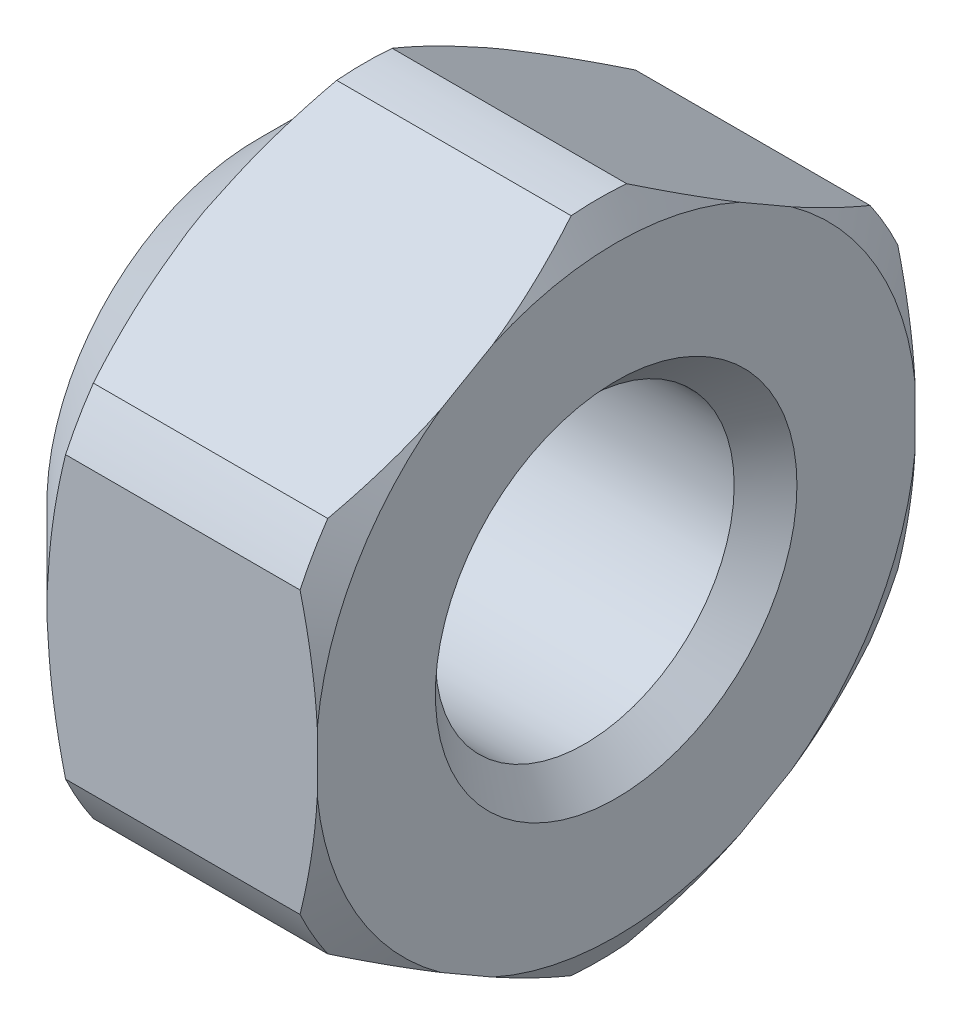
ISO-10303-21;
HEADER;
FILE_DESCRIPTION(('STEP AP214'),'2;1');
FILE_NAME('part.step','',(''),(''),'','','');
FILE_SCHEMA(('AUTOMOTIVE_DESIGN { 1 0 10303 214 1 1 1 1 }'));
ENDSEC;
DATA;
#1=APPLICATION_CONTEXT('core data for automotive mechanical design processes');
#2=APPLICATION_PROTOCOL_DEFINITION('international standard','automotive_design',2000,#1);
#3=PRODUCT_CONTEXT('',#1,'mechanical');
#4=PRODUCT('Part','Part','',(#3));
#5=PRODUCT_RELATED_PRODUCT_CATEGORY('part','',(#4));
#6=PRODUCT_DEFINITION_FORMATION('','',#4);
#7=PRODUCT_DEFINITION_CONTEXT('part definition',#1,'design');
#8=PRODUCT_DEFINITION('design','',#6,#7);
#9=PRODUCT_DEFINITION_SHAPE('','',#8);
#10=(LENGTH_UNIT() NAMED_UNIT(*) SI_UNIT(.MILLI.,.METRE.));
#11=(NAMED_UNIT(*) PLANE_ANGLE_UNIT() SI_UNIT($,.RADIAN.));
#12=(NAMED_UNIT(*) SI_UNIT($,.STERADIAN.) SOLID_ANGLE_UNIT());
#13=UNCERTAINTY_MEASURE_WITH_UNIT(LENGTH_MEASURE(1.E-05),#10,'distance_accuracy_value','');
#14=(GEOMETRIC_REPRESENTATION_CONTEXT(3) GLOBAL_UNCERTAINTY_ASSIGNED_CONTEXT((#13)) GLOBAL_UNIT_ASSIGNED_CONTEXT((#10,
#11,#12)) REPRESENTATION_CONTEXT('',''));
#15=CARTESIAN_POINT('',(0.,0.,0.));
#16=DIRECTION('',(0.,0.,1.));
#17=DIRECTION('',(1.,0.,0.));
#18=AXIS2_PLACEMENT_3D('',#15,#16,#17);
#19=CARTESIAN_POINT('',(0.,0.,0.));
#20=DIRECTION('',(1.,0.,0.));
#21=DIRECTION('',(0.,0.,-1.));
#22=AXIS2_PLACEMENT_3D('',#19,#20,#21);
#23=PLANE('',#22);
#24=CARTESIAN_POINT('',(0.,0.,0.));
#25=DIRECTION('',(1.,0.,0.));
#26=DIRECTION('',(0.,0.,-1.));
#27=AXIS2_PLACEMENT_3D('',#24,#25,#26);
#28=CIRCLE('',#27,3.025);
#29=CARTESIAN_POINT('',(0.,0.,-3.025));
#30=VERTEX_POINT('',#29);
#31=EDGE_CURVE('E503',#30,#30,#28,.T.);
#32=ORIENTED_EDGE('',*,*,#31,.F.);
#33=EDGE_LOOP('',(#32));
#34=FACE_BOUND('',#33,.T.);
#35=CARTESIAN_POINT('',(0.,0.,0.));
#36=DIRECTION('',(1.,0.,0.));
#37=DIRECTION('',(0.,0.,-1.));
#38=AXIS2_PLACEMENT_3D('',#35,#36,#37);
#39=CIRCLE('',#38,5.025);
#40=CARTESIAN_POINT('',(0.,0.50062460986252,-5.));
#41=VERTEX_POINT('',#40);
#42=CARTESIAN_POINT('',(0.,4.07981471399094,-2.9335536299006));
#43=VERTEX_POINT('',#42);
#44=EDGE_CURVE('E227',#41,#43,#39,.T.);
#45=ORIENTED_EDGE('',*,*,#44,.T.);
#46=DIRECTION('',(0.,0.5,0.866025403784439));
#47=VECTOR('',#46,1.);
#48=CARTESIAN_POINT('',(0.,2.88675134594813,-5.));
#49=LINE('',#48,#47);
#50=CARTESIAN_POINT('',(0.,4.58043932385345,-2.0664463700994));
#51=VERTEX_POINT('',#50);
#52=EDGE_CURVE('E213',#43,#51,#49,.T.);
#53=ORIENTED_EDGE('',*,*,#52,.T.);
#54=CARTESIAN_POINT('',(0.,4.58043932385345,2.06644637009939));
#55=VERTEX_POINT('',#54);
#56=EDGE_CURVE('E220',#51,#55,#39,.T.);
#57=ORIENTED_EDGE('',*,*,#56,.T.);
#58=DIRECTION('',(0.,-0.5,0.866025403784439));
#59=VECTOR('',#58,1.);
#60=CARTESIAN_POINT('',(0.,5.77350269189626,0.));
#61=LINE('',#60,#59);
#62=CARTESIAN_POINT('',(0.,4.07981471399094,2.93355362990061));
#63=VERTEX_POINT('',#62);
#64=EDGE_CURVE('E202',#55,#63,#61,.T.);
#65=ORIENTED_EDGE('',*,*,#64,.T.);
#66=CARTESIAN_POINT('',(0.,0.500624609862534,5.));
#67=VERTEX_POINT('',#66);
#68=EDGE_CURVE('E228',#63,#67,#39,.T.);
#69=ORIENTED_EDGE('',*,*,#68,.T.);
#70=DIRECTION('',(0.,-1.,0.));
#71=VECTOR('',#70,1.);
#72=CARTESIAN_POINT('',(0.,2.88675134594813,5.));
#73=LINE('',#72,#71);
#74=CARTESIAN_POINT('',(0.,-0.500624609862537,5.));
#75=VERTEX_POINT('',#74);
#76=EDGE_CURVE('E212',#67,#75,#73,.T.);
#77=ORIENTED_EDGE('',*,*,#76,.T.);
#78=CARTESIAN_POINT('',(0.,-4.07981471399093,2.93355362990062));
#79=VERTEX_POINT('',#78);
#80=EDGE_CURVE('E232',#75,#79,#39,.T.);
#81=ORIENTED_EDGE('',*,*,#80,.T.);
#82=DIRECTION('',(0.,-0.5,-0.866025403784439));
#83=VECTOR('',#82,1.);
#84=CARTESIAN_POINT('',(0.,-2.88675134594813,5.));
#85=LINE('',#84,#83);
#86=CARTESIAN_POINT('',(0.,-4.58043932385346,2.06644637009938));
#87=VERTEX_POINT('',#86);
#88=EDGE_CURVE('E519',#79,#87,#85,.T.);
#89=ORIENTED_EDGE('',*,*,#88,.T.);
#90=CARTESIAN_POINT('',(0.,-4.58043932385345,-2.0664463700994));
#91=VERTEX_POINT('',#90);
#92=EDGE_CURVE('E558',#87,#91,#39,.T.);
#93=ORIENTED_EDGE('',*,*,#92,.T.);
#94=DIRECTION('',(0.,0.5,-0.866025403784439));
#95=VECTOR('',#94,1.);
#96=CARTESIAN_POINT('',(0.,-5.77350269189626,0.));
#97=LINE('',#96,#95);
#98=CARTESIAN_POINT('',(0.,-4.07981471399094,-2.9335536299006));
#99=VERTEX_POINT('',#98);
#100=EDGE_CURVE('E521',#91,#99,#97,.T.);
#101=ORIENTED_EDGE('',*,*,#100,.T.);
#102=CARTESIAN_POINT('',(0.,-0.500624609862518,-5.));
#103=VERTEX_POINT('',#102);
#104=EDGE_CURVE('E231',#99,#103,#39,.T.);
#105=ORIENTED_EDGE('',*,*,#104,.T.);
#106=DIRECTION('',(0.,1.,0.));
#107=VECTOR('',#106,1.);
#108=CARTESIAN_POINT('',(0.,-2.88675134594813,-5.));
#109=LINE('',#108,#107);
#110=EDGE_CURVE('E282',#103,#41,#109,.T.);
#111=ORIENTED_EDGE('',*,*,#110,.T.);
#112=EDGE_LOOP('',(#45,#53,#57,#65,#69,#77,#81,#89,#93,#101,#105,#111));
#113=FACE_BOUND('',#112,.T.);
#114=ADVANCED_FACE('F37',(#34,#113),#23,.T.);
#115=CARTESIAN_POINT('',(0.,0.,0.));
#116=DIRECTION('',(1.,0.,0.));
#117=DIRECTION('',(0.,0.,-1.));
#118=AXIS2_PLACEMENT_3D('',#115,#116,#117);
#119=CYLINDRICAL_SURFACE('',#118,5.525);
#120=CARTESIAN_POINT('',(-0.288675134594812,0.,0.));
#121=DIRECTION('',(1.,0.,0.));
#122=DIRECTION('',(0.,0.,-1.));
#123=AXIS2_PLACEMENT_3D('',#120,#121,#122);
#124=CIRCLE('',#123,5.525);
#125=CARTESIAN_POINT('',(-0.288675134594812,5.50545941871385,0.464264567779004));
#126=VERTEX_POINT('',#125);
#127=CARTESIAN_POINT('',(-0.288675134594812,5.50545941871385,-0.464264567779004));
#128=VERTEX_POINT('',#127);
#129=EDGE_CURVE('E222',#126,#128,#124,.F.);
#130=ORIENTED_EDGE('',*,*,#129,.T.);
#131=DIRECTION('',(1.,0.,0.));
#132=VECTOR('',#131,1.);
#133=CARTESIAN_POINT('',(0.,5.50545941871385,-0.464264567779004));
#134=LINE('',#133,#132);
#135=CARTESIAN_POINT('',(-4.21132486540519,5.50545941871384,-0.464264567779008));
#136=VERTEX_POINT('',#135);
#137=EDGE_CURVE('E534',#128,#136,#134,.F.);
#138=ORIENTED_EDGE('',*,*,#137,.T.);
#139=CARTESIAN_POINT('',(-4.21132486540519,0.,0.));
#140=DIRECTION('',(-1.,0.,0.));
#141=DIRECTION('',(0.,0.,1.));
#142=AXIS2_PLACEMENT_3D('',#139,#140,#141);
#143=CIRCLE('',#142,5.525);
#144=CARTESIAN_POINT('',(-4.21132486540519,5.50545941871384,0.464264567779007));
#145=VERTEX_POINT('',#144);
#146=EDGE_CURVE('E445',#136,#145,#143,.F.);
#147=ORIENTED_EDGE('',*,*,#146,.T.);
#148=DIRECTION('',(1.,0.,0.));
#149=VECTOR('',#148,1.);
#150=CARTESIAN_POINT('',(0.,5.50545941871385,0.464264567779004));
#151=LINE('',#150,#149);
#152=EDGE_CURVE('E66',#145,#126,#151,.T.);
#153=ORIENTED_EDGE('',*,*,#152,.T.);
#154=EDGE_LOOP('',(#130,#138,#147,#153));
#155=FACE_BOUND('',#154,.T.);
#156=ADVANCED_FACE('F291',(#155),#119,.T.);
#157=CARTESIAN_POINT('',(-4.21132486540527,2.3506647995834,-5.));
#158=VERTEX_POINT('',#157);
#159=CARTESIAN_POINT('',(-4.21132486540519,3.15479461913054,-4.53573543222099));
#160=VERTEX_POINT('',#159);
#161=EDGE_CURVE('E447',#158,#160,#143,.F.);
#162=ORIENTED_EDGE('',*,*,#161,.T.);
#163=DIRECTION('',(1.,0.,0.));
#164=VECTOR('',#163,1.);
#165=CARTESIAN_POINT('',(0.,3.15479461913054,-4.535735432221));
#166=LINE('',#165,#164);
#167=CARTESIAN_POINT('',(-0.288675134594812,3.15479461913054,-4.535735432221));
#168=VERTEX_POINT('',#167);
#169=EDGE_CURVE('E535',#160,#168,#166,.T.);
#170=ORIENTED_EDGE('',*,*,#169,.T.);
#171=CARTESIAN_POINT('',(-0.288675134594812,2.3506647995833,-5.));
#172=VERTEX_POINT('',#171);
#173=EDGE_CURVE('E240',#168,#172,#124,.F.);
#174=ORIENTED_EDGE('',*,*,#173,.T.);
#175=DIRECTION('',(1.,0.,0.));
#176=VECTOR('',#175,1.);
#177=CARTESIAN_POINT('',(0.,2.3506647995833,-5.));
#178=LINE('',#177,#176);
#179=EDGE_CURVE('E363',#172,#158,#178,.F.);
#180=ORIENTED_EDGE('',*,*,#179,.T.);
#181=EDGE_LOOP('',(#162,#170,#174,#180));
#182=FACE_BOUND('',#181,.T.);
#183=ADVANCED_FACE('F500',(#182),#119,.T.);
#184=CARTESIAN_POINT('',(-4.21132486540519,-3.15479461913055,-4.53573543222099));
#185=VERTEX_POINT('',#184);
#186=CARTESIAN_POINT('',(-4.21132486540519,-2.3506647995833,-5.));
#187=VERTEX_POINT('',#186);
#188=EDGE_CURVE('E452',#185,#187,#143,.F.);
#189=ORIENTED_EDGE('',*,*,#188,.T.);
#190=DIRECTION('',(1.,0.,0.));
#191=VECTOR('',#190,1.);
#192=CARTESIAN_POINT('',(0.,-2.3506647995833,-5.));
#193=LINE('',#192,#191);
#194=CARTESIAN_POINT('',(-0.288675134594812,-2.3506647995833,-5.));
#195=VERTEX_POINT('',#194);
#196=EDGE_CURVE('E334',#187,#195,#193,.T.);
#197=ORIENTED_EDGE('',*,*,#196,.T.);
#198=CARTESIAN_POINT('',(-0.288675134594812,-3.15479461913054,-4.53573543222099));
#199=VERTEX_POINT('',#198);
#200=EDGE_CURVE('E242',#195,#199,#124,.F.);
#201=ORIENTED_EDGE('',*,*,#200,.T.);
#202=DIRECTION('',(1.,0.,0.));
#203=VECTOR('',#202,1.);
#204=CARTESIAN_POINT('',(0.,-3.15479461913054,-4.53573543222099));
#205=LINE('',#204,#203);
#206=EDGE_CURVE('E336',#199,#185,#205,.F.);
#207=ORIENTED_EDGE('',*,*,#206,.T.);
#208=EDGE_LOOP('',(#189,#197,#201,#207));
#209=FACE_BOUND('',#208,.T.);
#210=ADVANCED_FACE('F573',(#209),#119,.T.);
#211=CARTESIAN_POINT('',(-4.21132486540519,-5.50545941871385,0.464264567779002));
#212=VERTEX_POINT('',#211);
#213=CARTESIAN_POINT('',(-4.21132486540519,-5.50545941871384,-0.464264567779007));
#214=VERTEX_POINT('',#213);
#215=EDGE_CURVE('E241',#212,#214,#143,.F.);
#216=ORIENTED_EDGE('',*,*,#215,.T.);
#217=DIRECTION('',(1.,0.,0.));
#218=VECTOR('',#217,1.);
#219=CARTESIAN_POINT('',(0.,-5.50545941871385,-0.464264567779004));
#220=LINE('',#219,#218);
#221=CARTESIAN_POINT('',(-0.288675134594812,-5.50545941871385,-0.464264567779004));
#222=VERTEX_POINT('',#221);
#223=EDGE_CURVE('E397',#214,#222,#220,.T.);
#224=ORIENTED_EDGE('',*,*,#223,.T.);
#225=CARTESIAN_POINT('',(-0.288675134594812,-5.50545941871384,0.464264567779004));
#226=VERTEX_POINT('',#225);
#227=EDGE_CURVE('E246',#222,#226,#124,.F.);
#228=ORIENTED_EDGE('',*,*,#227,.T.);
#229=DIRECTION('',(1.,0.,0.));
#230=VECTOR('',#229,1.);
#231=CARTESIAN_POINT('',(0.,-5.50545941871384,0.464264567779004));
#232=LINE('',#231,#230);
#233=EDGE_CURVE('E410',#226,#212,#232,.F.);
#234=ORIENTED_EDGE('',*,*,#233,.T.);
#235=EDGE_LOOP('',(#216,#224,#228,#234));
#236=FACE_BOUND('',#235,.T.);
#237=ADVANCED_FACE('F463',(#236),#119,.T.);
#238=CARTESIAN_POINT('',(-4.21132486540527,-2.35066479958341,5.));
#239=VERTEX_POINT('',#238);
#240=CARTESIAN_POINT('',(-4.21132486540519,-3.15479461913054,4.535735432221));
#241=VERTEX_POINT('',#240);
#242=EDGE_CURVE('E237',#239,#241,#143,.F.);
#243=ORIENTED_EDGE('',*,*,#242,.T.);
#244=DIRECTION('',(1.,0.,0.));
#245=VECTOR('',#244,1.);
#246=CARTESIAN_POINT('',(0.,-3.15479461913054,4.535735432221));
#247=LINE('',#246,#245);
#248=CARTESIAN_POINT('',(-0.288675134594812,-3.15479461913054,4.535735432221));
#249=VERTEX_POINT('',#248);
#250=EDGE_CURVE('E415',#241,#249,#247,.T.);
#251=ORIENTED_EDGE('',*,*,#250,.T.);
#252=CARTESIAN_POINT('',(-0.288675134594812,-2.35066479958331,5.));
#253=VERTEX_POINT('',#252);
#254=EDGE_CURVE('E568',#249,#253,#124,.F.);
#255=ORIENTED_EDGE('',*,*,#254,.T.);
#256=DIRECTION('',(1.,0.,0.));
#257=VECTOR('',#256,1.);
#258=CARTESIAN_POINT('',(0.,-2.35066479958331,5.));
#259=LINE('',#258,#257);
#260=EDGE_CURVE('E428',#253,#239,#259,.F.);
#261=ORIENTED_EDGE('',*,*,#260,.T.);
#262=EDGE_LOOP('',(#243,#251,#255,#261));
#263=FACE_BOUND('',#262,.T.);
#264=ADVANCED_FACE('F606',(#263),#119,.T.);
#265=CARTESIAN_POINT('',(-4.21132486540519,3.15479461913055,4.53573543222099));
#266=VERTEX_POINT('',#265);
#267=CARTESIAN_POINT('',(-4.21132486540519,2.3506647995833,5.));
#268=VERTEX_POINT('',#267);
#269=EDGE_CURVE('E230',#266,#268,#143,.F.);
#270=ORIENTED_EDGE('',*,*,#269,.T.);
#271=DIRECTION('',(1.,0.,0.));
#272=VECTOR('',#271,1.);
#273=CARTESIAN_POINT('',(0.,2.3506647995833,5.));
#274=LINE('',#273,#272);
#275=CARTESIAN_POINT('',(-0.288675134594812,2.3506647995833,5.));
#276=VERTEX_POINT('',#275);
#277=EDGE_CURVE('E58',#268,#276,#274,.T.);
#278=ORIENTED_EDGE('',*,*,#277,.T.);
#279=CARTESIAN_POINT('',(-0.288675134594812,3.15479461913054,4.53573543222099));
#280=VERTEX_POINT('',#279);
#281=EDGE_CURVE('E441',#276,#280,#124,.F.);
#282=ORIENTED_EDGE('',*,*,#281,.T.);
#283=DIRECTION('',(1.,0.,0.));
#284=VECTOR('',#283,1.);
#285=CARTESIAN_POINT('',(0.,3.15479461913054,4.53573543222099));
#286=LINE('',#285,#284);
#287=EDGE_CURVE('E223',#280,#266,#286,.F.);
#288=ORIENTED_EDGE('',*,*,#287,.T.);
#289=EDGE_LOOP('',(#270,#278,#282,#288));
#290=FACE_BOUND('',#289,.T.);
#291=ADVANCED_FACE('F289',(#290),#119,.T.);
#292=CARTESIAN_POINT('',(-4.5,0.,0.));
#293=DIRECTION('',(1.,0.,0.));
#294=DIRECTION('',(0.,0.,-1.));
#295=AXIS2_PLACEMENT_3D('',#292,#293,#294);
#296=CONICAL_SURFACE('',#295,5.025,0.785398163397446);
#297=CARTESIAN_POINT('',(-6.,0.,0.));
#298=DIRECTION('',(1.,0.,0.));
#299=DIRECTION('',(0.,0.,-1.));
#300=AXIS2_PLACEMENT_3D('',#297,#298,#299);
#301=CIRCLE('',#300,3.52500000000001);
#302=CARTESIAN_POINT('',(-6.,0.,-3.52500000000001));
#303=VERTEX_POINT('',#302);
#304=EDGE_CURVE('E544',#303,#303,#301,.T.);
#305=ORIENTED_EDGE('',*,*,#304,.T.);
#306=EDGE_LOOP('',(#305));
#307=FACE_BOUND('',#306,.T.);
#308=CARTESIAN_POINT('',(-4.5,0.,0.));
#309=DIRECTION('',(1.,0.,0.));
#310=DIRECTION('',(0.,0.,-1.));
#311=AXIS2_PLACEMENT_3D('',#308,#309,#310);
#312=CIRCLE('',#311,5.025);
#313=CARTESIAN_POINT('',(-4.5,4.58043932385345,-2.0664463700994));
#314=VERTEX_POINT('',#313);
#315=CARTESIAN_POINT('',(-4.50000000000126,4.58043932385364,2.06644637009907));
#316=VERTEX_POINT('',#315);
#317=EDGE_CURVE('E553',#314,#316,#312,.T.);
#318=ORIENTED_EDGE('',*,*,#317,.F.);
#319=CARTESIAN_POINT('',(-4.4998,4.58144108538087,-2.06471126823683));
#320=CARTESIAN_POINT('',(-4.5166,4.49766972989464,-2.20980751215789));
#321=CARTESIAN_POINT('',(-4.525,4.41389837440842,-2.35490375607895));
#322=CARTESIAN_POINT('',(-4.525,4.24635566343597,-2.64509624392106));
#323=CARTESIAN_POINT('',(-4.5166,4.16258430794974,-2.79019248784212));
#324=CARTESIAN_POINT('',(-4.4998,4.07881295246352,-2.93528873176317));
#325=B_SPLINE_CURVE_WITH_KNOTS('',3,(#319,#320,#321,#322,#323,#324),.UNSPECIFIED.,.F.,.F.,(4,2,
4),(0.,0.503259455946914,1.00651891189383),.UNSPECIFIED.);
#326=CARTESIAN_POINT('',(-4.50000000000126,4.07981471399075,-2.93355362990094));
#327=VERTEX_POINT('',#326);
#328=EDGE_CURVE('E538',#314,#327,#325,.T.);
#329=ORIENTED_EDGE('',*,*,#328,.T.);
#330=CARTESIAN_POINT('',(-4.5,0.500624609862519,-5.));
#331=VERTEX_POINT('',#330);
#332=EDGE_CURVE('E235',#331,#327,#312,.T.);
#333=ORIENTED_EDGE('',*,*,#332,.F.);
#334=CARTESIAN_POINT('',(0.821651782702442,-9.05832231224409,-5.));
#335=CARTESIAN_POINT('',(0.665409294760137,-8.87984035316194,-5.));
#336=CARTESIAN_POINT('',(0.509758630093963,-8.70083666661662,-5.));
#337=CARTESIAN_POINT('',(0.19989241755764,-8.34157541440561,-5.));
#338=CARTESIAN_POINT('',(0.0456769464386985,-8.1613177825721,-5.));
#339=CARTESIAN_POINT('',(-0.261315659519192,-7.79904452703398,-5.));
#340=CARTESIAN_POINT('',(-0.414089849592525,-7.61702640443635,-5.));
#341=CARTESIAN_POINT('',(-0.717577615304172,-7.25128354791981,-5.));
#342=CARTESIAN_POINT('',(-0.868291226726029,-7.06755884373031,-5.));
#343=CARTESIAN_POINT('',(-1.17259131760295,-6.69144157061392,-5.));
#344=CARTESIAN_POINT('',(-1.32608630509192,-6.49897483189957,-5.));
#345=CARTESIAN_POINT('',(-1.62974280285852,-6.11143105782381,-5.));
#346=CARTESIAN_POINT('',(-1.77990439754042,-5.91635408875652,-5.));
#347=CARTESIAN_POINT('',(-2.07593198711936,-5.52316547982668,-5.));
#348=CARTESIAN_POINT('',(-2.22180084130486,-5.32505599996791,-5.));
#349=CARTESIAN_POINT('',(-2.50815718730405,-4.92499775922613,-5.));
#350=CARTESIAN_POINT('',(-2.64864519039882,-4.72304936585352,-5.));
#351=CARTESIAN_POINT('',(-2.92980727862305,-4.30372523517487,-5.));
#352=CARTESIAN_POINT('',(-3.07010533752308,-4.08609561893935,-5.));
#353=CARTESIAN_POINT('',(-3.34032407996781,-3.64428241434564,-5.));
#354=CARTESIAN_POINT('',(-3.4702399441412,-3.42009584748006,-5.));
#355=CARTESIAN_POINT('',(-3.71463429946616,-2.96592103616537,-5.));
#356=CARTESIAN_POINT('',(-3.82923919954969,-2.73600166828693,-5.));
#357=CARTESIAN_POINT('',(-4.03885566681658,-2.26749737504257,-5.));
#358=CARTESIAN_POINT('',(-4.13389021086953,-2.02892300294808,-5.));
#359=CARTESIAN_POINT('',(-4.27972078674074,-1.59533528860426,-5.));
#360=CARTESIAN_POINT('',(-4.33563953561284,-1.40206507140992,-5.));
#361=CARTESIAN_POINT('',(-4.4274353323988,-1.01057426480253,-5.));
#362=CARTESIAN_POINT('',(-4.46330382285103,-0.81235159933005,-5.));
#363=CARTESIAN_POINT('',(-4.5026701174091,-0.488859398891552,-5.));
#364=CARTESIAN_POINT('',(-4.51328536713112,-0.364430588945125,-5.));
#365=CARTESIAN_POINT('',(-4.52522326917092,-0.115110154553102,-5.));
#366=CARTESIAN_POINT('',(-4.52654575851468,0.00978147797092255,-5.));
#367=CARTESIAN_POINT('',(-4.5198376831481,0.259187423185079,-5.));
#368=CARTESIAN_POINT('',(-4.51181626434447,0.38370198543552,-5.));
#369=CARTESIAN_POINT('',(-4.48675196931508,0.631817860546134,-5.));
#370=CARTESIAN_POINT('',(-4.46970796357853,0.755419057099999,-5.));
#371=CARTESIAN_POINT('',(-4.41586527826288,1.06658137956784,-5.));
#372=CARTESIAN_POINT('',(-4.37338057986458,1.25317055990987,-5.));
#373=CARTESIAN_POINT('',(-4.27157980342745,1.62169457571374,-5.));
#374=CARTESIAN_POINT('',(-4.21225327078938,1.80362644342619,-5.));
#375=CARTESIAN_POINT('',(-4.07912995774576,2.16472836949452,-5.));
#376=CARTESIAN_POINT('',(-4.00515643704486,2.34383255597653,-5.));
#377=CARTESIAN_POINT('',(-3.88594440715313,2.60866845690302,-5.));
#378=CARTESIAN_POINT('',(-3.84483670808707,2.69630100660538,-5.));
#379=CARTESIAN_POINT('',(-3.76017020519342,2.87037365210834,-5.));
#380=CARTESIAN_POINT('',(-3.71661145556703,2.95681377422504,-5.));
#381=CARTESIAN_POINT('',(-3.59062144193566,3.19917818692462,-5.));
#382=CARTESIAN_POINT('',(-3.50567591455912,3.35379674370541,-5.));
#383=CARTESIAN_POINT('',(-3.33000621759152,3.65973025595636,-5.));
#384=CARTESIAN_POINT('',(-3.23928085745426,3.81104452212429,-5.));
#385=CARTESIAN_POINT('',(-3.05310113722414,4.11087552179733,-5.));
#386=CARTESIAN_POINT('',(-2.95764343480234,4.25939017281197,-5.));
#387=CARTESIAN_POINT('',(-2.76291124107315,4.55390164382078,-5.));
#388=CARTESIAN_POINT('',(-2.6636364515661,4.69989826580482,-5.));
#389=CARTESIAN_POINT('',(-2.36030400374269,5.13583027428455,-5.));
#390=CARTESIAN_POINT('',(-2.15151926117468,5.42247537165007,-5.));
#391=CARTESIAN_POINT('',(-1.72536824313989,5.98906891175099,-5.));
#392=CARTESIAN_POINT('',(-1.50800534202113,6.26901991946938,-5.));
#393=CARTESIAN_POINT('',(-1.08628544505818,6.79966749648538,-5.));
#394=CARTESIAN_POINT('',(-0.882452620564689,7.05078202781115,-5.));
#395=CARTESIAN_POINT('',(-0.470783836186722,7.54974672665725,-5.));
#396=CARTESIAN_POINT('',(-0.262947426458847,7.7975965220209,-5.));
#397=CARTESIAN_POINT('',(0.153855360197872,8.28835989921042,-5.));
#398=CARTESIAN_POINT('',(0.362792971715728,8.5312979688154,-5.));
#399=CARTESIAN_POINT('',(0.783066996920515,9.01500534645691,-5.));
#400=CARTESIAN_POINT('',(0.994402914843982,9.2557750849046,-5.));
#401=CARTESIAN_POINT('',(1.20666428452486,9.4957157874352,-5.));
#402=B_SPLINE_CURVE_WITH_KNOTS('',3,(#334,#335,#336,#337,#338,#339,#340,#341,#342,#343,#344,
#345,#346,#347,#348,#349,#350,#351,#352,#353,#354,#355,#356,#357,#358,#359,#360,#361,#362,#363,
#364,#365,#366,#367,#368,#369,#370,#371,#372,#373,#374,#375,#376,#377,#378,#379,#380,#381,#382,
#383,#384,#385,#386,#387,#388,#389,#390,#391,#392,#393,#394,#395,#396,#397,#398,#399,#400,#401),
.UNSPECIFIED.,.F.,.F.,(4,2,2,2,2,2,2,2,2,2,2,2,2,2,2,2,2,2,2,2,2,2,2,2,2,2,2,2,2,2,2,2,2,4),(0.,
0.71162607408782,1.42328998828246,2.13618323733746,2.84906409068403,3.5875720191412,
4.32606122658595,5.06404686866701,5.80196221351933,6.57854587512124,7.35548795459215,
8.12555625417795,8.89471522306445,9.49745986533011,10.1004615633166,10.474792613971,
10.8491302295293,11.2231017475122,11.5971200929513,12.1702076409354,12.743651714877,
13.3244908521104,13.6148470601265,13.9051968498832,14.4342761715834,14.9634648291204,
15.4930327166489,16.0226420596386,17.086233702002,18.1494110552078,19.1196452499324,
20.0899891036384,21.0512543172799,22.0123243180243),.UNSPECIFIED.);
#403=CARTESIAN_POINT('',(-4.5,-0.500624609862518,-5.));
#404=VERTEX_POINT('',#403);
#405=EDGE_CURVE('E325',#331,#404,#402,.F.);
#406=ORIENTED_EDGE('',*,*,#405,.T.);
#407=CARTESIAN_POINT('',(-4.5,-4.07981471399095,-2.9335536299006));
#408=VERTEX_POINT('',#407);
#409=EDGE_CURVE('E546',#408,#404,#312,.T.);
#410=ORIENTED_EDGE('',*,*,#409,.F.);
#411=CARTESIAN_POINT('',(-4.4998,-4.07881295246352,-2.93528873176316));
#412=CARTESIAN_POINT('',(-4.5166,-4.16258430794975,-2.79019248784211));
#413=CARTESIAN_POINT('',(-4.525,-4.24635566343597,-2.64509624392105));
#414=CARTESIAN_POINT('',(-4.525,-4.41389837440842,-2.35490375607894));
#415=CARTESIAN_POINT('',(-4.5166,-4.49766972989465,-2.20980751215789));
#416=CARTESIAN_POINT('',(-4.4998,-4.58144108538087,-2.06471126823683));
#417=B_SPLINE_CURVE_WITH_KNOTS('',3,(#411,#412,#413,#414,#415,#416),.UNSPECIFIED.,.F.,.F.,(4,2,
4),(0.,0.50325945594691,1.00651891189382),.UNSPECIFIED.);
#418=CARTESIAN_POINT('',(-4.50000000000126,-4.58043932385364,-2.06644637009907));
#419=VERTEX_POINT('',#418);
#420=EDGE_CURVE('E316',#408,#419,#417,.T.);
#421=ORIENTED_EDGE('',*,*,#420,.T.);
#422=CARTESIAN_POINT('',(-4.5,-4.58043932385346,2.06644637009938));
#423=VERTEX_POINT('',#422);
#424=EDGE_CURVE('E470',#423,#419,#312,.T.);
#425=ORIENTED_EDGE('',*,*,#424,.F.);
#426=CARTESIAN_POINT('',(-4.4998,-4.58144108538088,2.06471126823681));
#427=CARTESIAN_POINT('',(-4.5166,-4.49766972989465,2.20980751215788));
#428=CARTESIAN_POINT('',(-4.525,-4.41389837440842,2.35490375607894));
#429=CARTESIAN_POINT('',(-4.525,-4.24635566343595,2.64509624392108));
#430=CARTESIAN_POINT('',(-4.5166,-4.16258430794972,2.79019248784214));
#431=CARTESIAN_POINT('',(-4.4998,-4.07881295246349,2.93528873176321));
#432=B_SPLINE_CURVE_WITH_KNOTS('',3,(#426,#427,#428,#429,#430,#431),.UNSPECIFIED.,.F.,.F.,(4,2,
4),(0.,0.50325945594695,1.0065189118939),.UNSPECIFIED.);
#433=CARTESIAN_POINT('',(-4.50000000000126,-4.07981471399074,2.93355362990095));
#434=VERTEX_POINT('',#433);
#435=EDGE_CURVE('E308',#423,#434,#432,.T.);
#436=ORIENTED_EDGE('',*,*,#435,.T.);
#437=CARTESIAN_POINT('',(-4.5,-0.500624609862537,5.));
#438=VERTEX_POINT('',#437);
#439=EDGE_CURVE('E551',#438,#434,#312,.T.);
#440=ORIENTED_EDGE('',*,*,#439,.F.);
#441=CARTESIAN_POINT('',(0.82165178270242,-9.05832231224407,5.));
#442=CARTESIAN_POINT('',(0.665409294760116,-8.87984035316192,5.));
#443=CARTESIAN_POINT('',(0.509758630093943,-8.7008366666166,5.));
#444=CARTESIAN_POINT('',(0.199892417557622,-8.34157541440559,5.));
#445=CARTESIAN_POINT('',(0.045676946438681,-8.16131778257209,5.));
#446=CARTESIAN_POINT('',(-0.261315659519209,-7.79904452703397,5.));
#447=CARTESIAN_POINT('',(-0.414089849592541,-7.61702640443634,5.));
#448=CARTESIAN_POINT('',(-0.717577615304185,-7.2512835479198,5.));
#449=CARTESIAN_POINT('',(-0.868291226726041,-7.06755884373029,5.));
#450=CARTESIAN_POINT('',(-1.17259131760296,-6.69144157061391,5.));
#451=CARTESIAN_POINT('',(-1.32608630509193,-6.49897483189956,5.));
#452=CARTESIAN_POINT('',(-1.62974280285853,-6.1114310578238,5.));
#453=CARTESIAN_POINT('',(-1.77990439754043,-5.91635408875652,5.));
#454=CARTESIAN_POINT('',(-2.07593198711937,-5.52316547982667,5.));
#455=CARTESIAN_POINT('',(-2.22180084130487,-5.3250559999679,5.));
#456=CARTESIAN_POINT('',(-2.50815718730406,-4.92499775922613,5.));
#457=CARTESIAN_POINT('',(-2.64864519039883,-4.72304936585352,5.));
#458=CARTESIAN_POINT('',(-2.92980727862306,-4.30372523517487,5.));
#459=CARTESIAN_POINT('',(-3.07010533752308,-4.08609561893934,5.));
#460=CARTESIAN_POINT('',(-3.34032407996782,-3.64428241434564,5.));
#461=CARTESIAN_POINT('',(-3.47023994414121,-3.42009584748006,5.));
#462=CARTESIAN_POINT('',(-3.71463429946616,-2.96592103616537,5.));
#463=CARTESIAN_POINT('',(-3.8292391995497,-2.73600166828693,5.));
#464=CARTESIAN_POINT('',(-4.03885566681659,-2.26749737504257,5.));
#465=CARTESIAN_POINT('',(-4.13389021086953,-2.02892300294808,5.));
#466=CARTESIAN_POINT('',(-4.27972078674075,-1.59533528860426,5.));
#467=CARTESIAN_POINT('',(-4.33563953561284,-1.40206507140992,5.));
#468=CARTESIAN_POINT('',(-4.4274353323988,-1.01057426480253,5.));
#469=CARTESIAN_POINT('',(-4.46330382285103,-0.81235159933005,5.));
#470=CARTESIAN_POINT('',(-4.5026701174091,-0.488859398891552,5.));
#471=CARTESIAN_POINT('',(-4.51328536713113,-0.364430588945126,5.));
#472=CARTESIAN_POINT('',(-4.52522326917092,-0.115110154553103,5.));
#473=CARTESIAN_POINT('',(-4.52654575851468,0.00978147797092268,5.));
#474=CARTESIAN_POINT('',(-4.5198376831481,0.25918742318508,5.));
#475=CARTESIAN_POINT('',(-4.51181626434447,0.383701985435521,5.));
#476=CARTESIAN_POINT('',(-4.48675196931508,0.631817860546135,5.));
#477=CARTESIAN_POINT('',(-4.46970796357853,0.755419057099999,5.));
#478=CARTESIAN_POINT('',(-4.41586527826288,1.06658137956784,5.));
#479=CARTESIAN_POINT('',(-4.37338057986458,1.25317055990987,5.));
#480=CARTESIAN_POINT('',(-4.27157980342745,1.62169457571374,5.));
#481=CARTESIAN_POINT('',(-4.21225327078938,1.80362644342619,5.));
#482=CARTESIAN_POINT('',(-4.07912995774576,2.16472836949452,5.));
#483=CARTESIAN_POINT('',(-4.00515643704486,2.34383255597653,5.));
#484=CARTESIAN_POINT('',(-3.88594440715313,2.60866845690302,5.));
#485=CARTESIAN_POINT('',(-3.84483670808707,2.69630100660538,5.));
#486=CARTESIAN_POINT('',(-3.76017020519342,2.87037365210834,5.));
#487=CARTESIAN_POINT('',(-3.71661145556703,2.95681377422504,5.));
#488=CARTESIAN_POINT('',(-3.59062144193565,3.19917818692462,5.));
#489=CARTESIAN_POINT('',(-3.50567591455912,3.35379674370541,5.));
#490=CARTESIAN_POINT('',(-3.33000621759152,3.65973025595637,5.));
#491=CARTESIAN_POINT('',(-3.23928085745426,3.8110445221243,5.));
#492=CARTESIAN_POINT('',(-3.05310113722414,4.11087552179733,5.));
#493=CARTESIAN_POINT('',(-2.95764343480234,4.25939017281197,5.));
#494=CARTESIAN_POINT('',(-2.76291124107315,4.55390164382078,5.));
#495=CARTESIAN_POINT('',(-2.66363645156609,4.69989826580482,5.));
#496=CARTESIAN_POINT('',(-2.36030400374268,5.13583027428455,5.));
#497=CARTESIAN_POINT('',(-2.15151926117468,5.42247537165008,5.));
#498=CARTESIAN_POINT('',(-1.72536824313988,5.989068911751,5.));
#499=CARTESIAN_POINT('',(-1.50800534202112,6.26901991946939,5.));
#500=CARTESIAN_POINT('',(-1.08628544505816,6.7996674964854,5.));
#501=CARTESIAN_POINT('',(-0.882452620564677,7.05078202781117,5.));
#502=CARTESIAN_POINT('',(-0.470783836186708,7.54974672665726,5.));
#503=CARTESIAN_POINT('',(-0.262947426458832,7.79759652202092,5.));
#504=CARTESIAN_POINT('',(0.153855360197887,8.28835989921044,5.));
#505=CARTESIAN_POINT('',(0.362792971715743,8.53129796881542,5.));
#506=CARTESIAN_POINT('',(0.783066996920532,9.01500534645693,5.));
#507=CARTESIAN_POINT('',(0.994402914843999,9.25577508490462,5.));
#508=CARTESIAN_POINT('',(1.20666428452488,9.49571578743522,5.));
#509=B_SPLINE_CURVE_WITH_KNOTS('',3,(#441,#442,#443,#444,#445,#446,#447,#448,#449,#450,#451,
#452,#453,#454,#455,#456,#457,#458,#459,#460,#461,#462,#463,#464,#465,#466,#467,#468,#469,#470,
#471,#472,#473,#474,#475,#476,#477,#478,#479,#480,#481,#482,#483,#484,#485,#486,#487,#488,#489,
#490,#491,#492,#493,#494,#495,#496,#497,#498,#499,#500,#501,#502,#503,#504,#505,#506,#507,#508),
.UNSPECIFIED.,.F.,.F.,(4,2,2,2,2,2,2,2,2,2,2,2,2,2,2,2,2,2,2,2,2,2,2,2,2,2,2,2,2,2,2,2,2,4),(0.,
0.711626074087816,1.42328998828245,2.13618323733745,2.84906409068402,3.58757201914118,
4.32606122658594,5.06404686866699,5.8019622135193,6.57854587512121,7.35548795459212,
8.12555625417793,8.89471522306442,9.49745986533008,10.1004615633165,10.4747926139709,
10.8491302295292,11.2231017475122,11.5971200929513,12.1702076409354,12.743651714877,
13.3244908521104,13.6148470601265,13.9051968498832,14.4342761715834,14.9634648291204,
15.4930327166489,16.0226420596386,17.086233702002,18.1494110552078,19.1196452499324,
20.0899891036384,21.0512543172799,22.0123243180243),.UNSPECIFIED.);
#510=CARTESIAN_POINT('',(-4.5,0.500624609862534,5.));
#511=VERTEX_POINT('',#510);
#512=EDGE_CURVE('E299',#438,#511,#509,.T.);
#513=ORIENTED_EDGE('',*,*,#512,.T.);
#514=CARTESIAN_POINT('',(-4.5,4.07981471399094,2.9335536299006));
#515=VERTEX_POINT('',#514);
#516=EDGE_CURVE('E560',#515,#511,#312,.T.);
#517=ORIENTED_EDGE('',*,*,#516,.F.);
#518=CARTESIAN_POINT('',(-4.4998,4.07881295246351,2.93528873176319));
#519=CARTESIAN_POINT('',(-4.5166,4.16258430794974,2.79019248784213));
#520=CARTESIAN_POINT('',(-4.525,4.24635566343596,2.64509624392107));
#521=CARTESIAN_POINT('',(-4.525,4.41389837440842,2.35490375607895));
#522=CARTESIAN_POINT('',(-4.5166,4.49766972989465,2.20980751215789));
#523=CARTESIAN_POINT('',(-4.4998,4.58144108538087,2.06471126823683));
#524=B_SPLINE_CURVE_WITH_KNOTS('',3,(#518,#519,#520,#521,#522,#523),.UNSPECIFIED.,.F.,.F.,(4,2,
4),(0.,0.503259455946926,1.00651891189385),.UNSPECIFIED.);
#525=EDGE_CURVE('E273',#515,#316,#524,.T.);
#526=ORIENTED_EDGE('',*,*,#525,.T.);
#527=EDGE_LOOP('',(#318,#329,#333,#406,#410,#421,#425,#436,#440,#513,#517,#526));
#528=FACE_BOUND('',#527,.T.);
#529=ADVANCED_FACE('F284',(#307,#528),#296,.T.);
#530=CARTESIAN_POINT('',(0.,0.,0.));
#531=DIRECTION('',(-1.,0.,0.));
#532=DIRECTION('',(0.,0.,1.));
#533=AXIS2_PLACEMENT_3D('',#530,#531,#532);
#534=CONICAL_SURFACE('',#533,5.025,1.0471975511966);
#535=ORIENTED_EDGE('',*,*,#173,.F.);
#536=CARTESIAN_POINT('',(-1.97598303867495,0.925706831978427,-8.39662873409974));
#537=CARTESIAN_POINT('',(-1.89181713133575,1.01615890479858,-8.23996114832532));
#538=CARTESIAN_POINT('',(-1.80858508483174,1.10683170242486,-8.08291125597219));
#539=CARTESIAN_POINT('',(-1.64442857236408,1.28871181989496,-7.76788565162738));
#540=CARTESIAN_POINT('',(-1.56350441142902,1.37991920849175,-7.60990982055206));
#541=CARTESIAN_POINT('',(-1.40415969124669,1.56324410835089,-7.29238177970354));
#542=CARTESIAN_POINT('',(-1.32574841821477,1.65536364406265,-7.13282606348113));
#543=CARTESIAN_POINT('',(-1.17231861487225,1.8403048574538,-6.81249848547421));
#544=CARTESIAN_POINT('',(-1.09729997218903,1.93312651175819,-6.65172666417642));
#545=CARTESIAN_POINT('',(-0.949657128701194,2.12180917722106,-6.32491870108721));
#546=CARTESIAN_POINT('',(-0.877132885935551,2.2176898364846,-6.15884852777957));
#547=CARTESIAN_POINT('',(-0.737424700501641,2.4104291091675,-5.82501431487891));
#548=CARTESIAN_POINT('',(-0.670241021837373,2.50728777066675,-5.65725019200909));
#549=CARTESIAN_POINT('',(-0.54253289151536,2.70199752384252,-5.32000300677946));
#550=CARTESIAN_POINT('',(-0.482001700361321,2.79984749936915,-5.15052187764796));
#551=CARTESIAN_POINT('',(-0.369032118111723,2.99669586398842,-4.80957050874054));
#552=CARTESIAN_POINT('',(-0.316592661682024,3.09569410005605,-4.63810053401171));
#553=CARTESIAN_POINT('',(-0.203299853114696,3.33309350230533,-4.22691270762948));
#554=CARTESIAN_POINT('',(-0.146926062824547,3.47205280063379,-3.98622814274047));
#555=CARTESIAN_POINT('',(-0.0800245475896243,3.68187070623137,-3.62281286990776));
#556=CARTESIAN_POINT('',(-0.0606674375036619,3.75203848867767,-3.50127870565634));
#557=CARTESIAN_POINT('',(-0.0283340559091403,3.89273764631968,-3.25758061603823));
#558=CARTESIAN_POINT('',(-0.0153569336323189,3.96326897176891,-3.13541677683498));
#559=CARTESIAN_POINT('',(0.0037330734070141,4.10377696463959,-2.89204979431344));
#560=CARTESIAN_POINT('',(0.00992065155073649,4.17375108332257,-2.77085106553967));
#561=CARTESIAN_POINT('',(0.0155025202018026,4.31376682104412,-2.52833669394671));
#562=CARTESIAN_POINT('',(0.0148969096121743,4.38380843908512,-2.40702105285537));
#563=CARTESIAN_POINT('',(0.00691001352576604,4.52379938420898,-2.16454962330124));
#564=CARTESIAN_POINT('',(-0.000471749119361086,4.59374870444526,-2.0433938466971));
#565=CARTESIAN_POINT('',(-0.0217892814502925,4.73339871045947,-1.8015129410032));
#566=CARTESIAN_POINT('',(-0.0357255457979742,4.80309937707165,-1.68078784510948));
#567=CARTESIAN_POINT('',(-0.0765012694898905,4.96961185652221,-1.39237977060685));
#568=CARTESIAN_POINT('',(-0.106263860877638,5.06624602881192,-1.22500447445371));
#569=CARTESIAN_POINT('',(-0.176395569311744,5.25854676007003,-0.891929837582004));
#570=CARTESIAN_POINT('',(-0.21676658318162,5.35421314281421,-0.72623080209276));
#571=CARTESIAN_POINT('',(-0.306579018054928,5.54456951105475,-0.396523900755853));
#572=CARTESIAN_POINT('',(-0.356029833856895,5.63925837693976,-0.232517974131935));
#573=CARTESIAN_POINT('',(-0.462455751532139,5.82755913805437,0.0936285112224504));
#574=CARTESIAN_POINT('',(-0.519430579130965,5.92117107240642,0.255769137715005));
#575=CARTESIAN_POINT('',(-0.64022599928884,6.10840981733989,0.580076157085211));
#576=CARTESIAN_POINT('',(-0.704114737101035,6.2020255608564,0.742223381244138));
#577=CARTESIAN_POINT('',(-0.837057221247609,6.38833135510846,1.06491448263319));
#578=CARTESIAN_POINT('',(-0.906111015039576,6.48102139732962,1.22545834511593));
#579=CARTESIAN_POINT('',(-1.04839931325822,6.66553364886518,1.54504293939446));
#580=CARTESIAN_POINT('',(-1.12163150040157,6.75735630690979,1.70408444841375));
#581=CARTESIAN_POINT('',(-1.27155102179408,6.94028925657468,2.02093361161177));
#582=CARTESIAN_POINT('',(-1.34823827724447,7.03139956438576,2.1787412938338));
#583=CARTESIAN_POINT('',(-1.47074654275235,7.17380803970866,2.42540000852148));
#584=CARTESIAN_POINT('',(-1.51560206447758,7.22531484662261,2.51461241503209));
#585=CARTESIAN_POINT('',(-1.60614258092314,7.32814455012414,2.69271868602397));
#586=CARTESIAN_POINT('',(-1.65182755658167,7.3794674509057,2.78161255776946));
#587=CARTESIAN_POINT('',(-1.74354686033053,7.48150264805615,2.95834270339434));
#588=CARTESIAN_POINT('',(-1.78957476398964,7.53221638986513,3.04618148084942));
#589=CARTESIAN_POINT('',(-1.88229668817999,7.63349237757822,3.22159663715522));
#590=CARTESIAN_POINT('',(-1.92899071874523,7.68405462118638,3.30917301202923));
#591=CARTESIAN_POINT('',(-1.97598303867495,7.73454720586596,3.39662873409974));
#592=B_SPLINE_CURVE_WITH_KNOTS('',3,(#536,#537,#538,#539,#540,#541,#542,#543,#544,#545,#546,
#547,#548,#549,#550,#551,#552,#553,#554,#555,#556,#557,#558,#559,#560,#561,#562,#563,#564,#565,
#566,#567,#568,#569,#570,#571,#572,#573,#574,#575,#576,#577,#578,#579,#580,#581,#582,#583,#584,
#585,#586,#587,#588,#589,#590,#591),.UNSPECIFIED.,.F.,.F.,(4,2,2,2,2,2,2,2,2,2,2,2,2,2,2,2,2,2,
2,2,2,2,2,2,2,2,2,4),(0.,0.598581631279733,1.19724201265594,1.79790613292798,2.39855034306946,
3.01353784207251,3.62855572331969,4.24294468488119,4.85725268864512,5.70703000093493,
6.13190251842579,6.5567183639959,6.97681234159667,7.39690020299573,7.81701764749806,
8.23716680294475,8.82344750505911,9.40983310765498,9.99682889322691,10.5838032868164,
11.1772066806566,11.7706155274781,12.3636984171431,12.9567677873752,13.2938320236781,
13.6308885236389,13.96503413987,14.299184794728),.UNSPECIFIED.);
#593=EDGE_CURVE('E532',#168,#43,#592,.T.);
#594=ORIENTED_EDGE('',*,*,#593,.T.);
#595=ORIENTED_EDGE('',*,*,#44,.F.);
#596=CARTESIAN_POINT('',(-1.76753563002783,-6.35538038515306,-5.));
#597=CARTESIAN_POINT('',(-1.68559893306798,-6.17475778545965,-5.));
#598=CARTESIAN_POINT('',(-1.60473138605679,-5.99364075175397,-5.));
#599=CARTESIAN_POINT('',(-1.44565341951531,-5.63020602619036,-5.));
#600=CARTESIAN_POINT('',(-1.36744348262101,-5.44788812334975,-5.));
#601=CARTESIAN_POINT('',(-1.21390907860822,-5.08113947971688,-5.));
#602=CARTESIAN_POINT('',(-1.13859805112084,-4.89670309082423,-5.));
#603=CARTESIAN_POINT('',(-0.991925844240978,-4.52627024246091,-5.));
#604=CARTESIAN_POINT('',(-0.920564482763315,-4.34027385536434,-5.));
#605=CARTESIAN_POINT('',(-0.782982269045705,-3.96733521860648,-5.));
#606=CARTESIAN_POINT('',(-0.716739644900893,-3.78040104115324,-5.));
#607=CARTESIAN_POINT('',(-0.590115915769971,-3.40453270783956,-5.));
#608=CARTESIAN_POINT('',(-0.529735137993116,-3.21559844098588,-5.));
#609=CARTESIAN_POINT('',(-0.416222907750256,-2.83583135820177,-5.));
#610=CARTESIAN_POINT('',(-0.363081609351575,-2.64500150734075,-5.));
#611=CARTESIAN_POINT('',(-0.265462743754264,-2.26111571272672,-5.));
#612=CARTESIAN_POINT('',(-0.220984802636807,-2.06805986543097,-5.));
#613=CARTESIAN_POINT('',(-0.153448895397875,-1.73474995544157,-5.));
#614=CARTESIAN_POINT('',(-0.127890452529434,-1.59500231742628,-5.));
#615=CARTESIAN_POINT('',(-0.0826593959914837,-1.31457200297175,-5.));
#616=CARTESIAN_POINT('',(-0.0629858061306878,-1.17388948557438,-5.));
#617=CARTESIAN_POINT('',(-0.0300394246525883,-0.891797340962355,-5.));
#618=CARTESIAN_POINT('',(-0.0167654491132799,-0.750387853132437,-5.));
#619=CARTESIAN_POINT('',(0.00300131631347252,-0.467091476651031,-5.));
#620=CARTESIAN_POINT('',(0.00949412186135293,-0.325204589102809,-5.));
#621=CARTESIAN_POINT('',(0.0154959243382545,-0.0413530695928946,-5.));
#622=CARTESIAN_POINT('',(0.0150084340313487,0.100611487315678,-5.));
#623=CARTESIAN_POINT('',(0.00707398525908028,0.384342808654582,-5.));
#624=CARTESIAN_POINT('',(-0.000372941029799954,0.526109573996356,-5.));
#625=CARTESIAN_POINT('',(-0.0219991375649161,0.809131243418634,-5.));
#626=CARTESIAN_POINT('',(-0.0361786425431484,0.950386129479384,-5.));
#627=CARTESIAN_POINT('',(-0.0708607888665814,1.23212773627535,-5.));
#628=CARTESIAN_POINT('',(-0.0913645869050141,1.37261431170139,-5.));
#629=CARTESIAN_POINT('',(-0.18486348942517,1.93181867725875,-5.));
#630=CARTESIAN_POINT('',(-0.281005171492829,2.34677633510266,-5.));
#631=CARTESIAN_POINT('',(-0.452338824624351,2.96155727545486,-5.));
#632=CARTESIAN_POINT('',(-0.514070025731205,3.1654732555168,-5.));
#633=CARTESIAN_POINT('',(-0.644869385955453,3.57095716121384,-5.));
#634=CARTESIAN_POINT('',(-0.713937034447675,3.77252524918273,-5.));
#635=CARTESIAN_POINT('',(-0.858781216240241,4.17579487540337,-5.));
#636=CARTESIAN_POINT('',(-0.934625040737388,4.37747192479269,-5.));
#637=CARTESIAN_POINT('',(-1.09115881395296,4.77894593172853,-5.));
#638=CARTESIAN_POINT('',(-1.1718490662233,4.9787427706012,-5.));
#639=CARTESIAN_POINT('',(-1.33661553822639,5.37547983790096,-5.));
#640=CARTESIAN_POINT('',(-1.4206677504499,5.57243008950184,-5.));
#641=CARTESIAN_POINT('',(-1.59191327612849,5.96490477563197,-5.));
#642=CARTESIAN_POINT('',(-1.67910581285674,6.1604295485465,-5.));
#643=CARTESIAN_POINT('',(-1.76753563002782,6.35538038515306,-5.));
#644=B_SPLINE_CURVE_WITH_KNOTS('',3,(#596,#597,#598,#599,#600,#601,#602,#603,#604,#605,#606,
#607,#608,#609,#610,#611,#612,#613,#614,#615,#616,#617,#618,#619,#620,#621,#622,#623,#624,#625,
#626,#627,#628,#629,#630,#631,#632,#633,#634,#635,#636,#637,#638,#639,#640,#641,#642,#643),
.UNSPECIFIED.,.F.,.F.,(4,2,2,2,2,2,2,2,2,2,2,2,2,2,2,2,2,2,2,2,2,2,2,4),(0.,0.595024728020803,
1.19015694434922,1.78777880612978,2.38537309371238,2.9802669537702,3.57519400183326,
4.16930367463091,4.7633876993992,5.18947565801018,5.6154928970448,6.0414312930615,
6.46736870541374,6.89309177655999,7.3188128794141,7.74454882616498,8.17036268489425,
9.44520935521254,10.0843275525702,10.723401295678,11.3697338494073,12.0161069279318,
12.6584853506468,13.3007059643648),.UNSPECIFIED.);
#645=EDGE_CURVE('E364',#41,#172,#644,.T.);
#646=ORIENTED_EDGE('',*,*,#645,.T.);
#647=EDGE_LOOP('',(#535,#594,#595,#646));
#648=FACE_BOUND('',#647,.T.);
#649=ADVANCED_FACE('F288',(#648),#534,.T.);
#650=ORIENTED_EDGE('',*,*,#56,.F.);
#651=EDGE_CURVE('E536',#51,#128,#592,.T.);
#652=ORIENTED_EDGE('',*,*,#651,.T.);
#653=ORIENTED_EDGE('',*,*,#129,.F.);
#654=CARTESIAN_POINT('',(-1.97598303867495,7.73454720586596,-3.39662873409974));
#655=CARTESIAN_POINT('',(-1.89181713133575,7.64409513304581,-3.23996114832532));
#656=CARTESIAN_POINT('',(-1.80858508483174,7.55342233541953,-3.08291125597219));
#657=CARTESIAN_POINT('',(-1.64442857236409,7.37154221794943,-2.76788565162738));
#658=CARTESIAN_POINT('',(-1.56350441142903,7.28033482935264,-2.60990982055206));
#659=CARTESIAN_POINT('',(-1.40415969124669,7.09700992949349,-2.29238177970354));
#660=CARTESIAN_POINT('',(-1.32574841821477,7.00489039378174,-2.13282606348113));
#661=CARTESIAN_POINT('',(-1.17231861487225,6.81994918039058,-1.81249848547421));
#662=CARTESIAN_POINT('',(-1.09729997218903,6.7271275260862,-1.65172666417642));
#663=CARTESIAN_POINT('',(-0.949657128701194,6.53844486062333,-1.32491870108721));
#664=CARTESIAN_POINT('',(-0.877132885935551,6.44256420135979,-1.15884852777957));
#665=CARTESIAN_POINT('',(-0.737424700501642,6.24982492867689,-0.825014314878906));
#666=CARTESIAN_POINT('',(-0.670241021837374,6.15296626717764,-0.65725019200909));
#667=CARTESIAN_POINT('',(-0.542532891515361,5.95825651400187,-0.320003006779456));
#668=CARTESIAN_POINT('',(-0.482001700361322,5.86040653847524,-0.150521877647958));
#669=CARTESIAN_POINT('',(-0.369032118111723,5.66355817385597,0.190429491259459));
#670=CARTESIAN_POINT('',(-0.316592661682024,5.56455993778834,0.361899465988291));
#671=CARTESIAN_POINT('',(-0.203299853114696,5.32716053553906,0.773087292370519));
#672=CARTESIAN_POINT('',(-0.146926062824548,5.1882012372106,1.01377185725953));
#673=CARTESIAN_POINT('',(-0.0800245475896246,4.97838333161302,1.37718713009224));
#674=CARTESIAN_POINT('',(-0.0606674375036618,4.90821554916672,1.49872129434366));
#675=CARTESIAN_POINT('',(-0.0283340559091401,4.76751639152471,1.74241938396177));
#676=CARTESIAN_POINT('',(-0.0153569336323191,4.69698506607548,1.86458322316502));
#677=CARTESIAN_POINT('',(0.00373307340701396,4.5564770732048,2.10795020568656));
#678=CARTESIAN_POINT('',(0.00992065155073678,4.48650295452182,2.22914893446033));
#679=CARTESIAN_POINT('',(0.0155025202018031,4.34648721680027,2.4716633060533));
#680=CARTESIAN_POINT('',(0.0148969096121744,4.27644559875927,2.59297894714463));
#681=CARTESIAN_POINT('',(0.00691001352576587,4.13645465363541,2.83545037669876));
#682=CARTESIAN_POINT('',(-0.00047174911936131,4.06650533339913,2.9566061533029));
#683=CARTESIAN_POINT('',(-0.0217892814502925,3.92685532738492,3.1984870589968));
#684=CARTESIAN_POINT('',(-0.035725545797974,3.85715466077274,3.31921215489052));
#685=CARTESIAN_POINT('',(-0.0765012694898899,3.69064218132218,3.60762022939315));
#686=CARTESIAN_POINT('',(-0.106263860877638,3.59400800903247,3.77499552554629));
#687=CARTESIAN_POINT('',(-0.176395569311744,3.40170727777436,4.108070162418));
#688=CARTESIAN_POINT('',(-0.21676658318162,3.30604089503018,4.27376919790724));
#689=CARTESIAN_POINT('',(-0.306579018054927,3.11568452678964,4.60347609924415));
#690=CARTESIAN_POINT('',(-0.356029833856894,3.02099566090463,4.76748202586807));
#691=CARTESIAN_POINT('',(-0.462455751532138,2.83269489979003,5.09362851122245));
#692=CARTESIAN_POINT('',(-0.519430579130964,2.73908296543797,5.255769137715));
#693=CARTESIAN_POINT('',(-0.640225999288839,2.5518442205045,5.58007615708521));
#694=CARTESIAN_POINT('',(-0.704114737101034,2.45822847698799,5.74222338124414));
#695=CARTESIAN_POINT('',(-0.837057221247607,2.27192268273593,6.06491448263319));
#696=CARTESIAN_POINT('',(-0.906111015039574,2.17923264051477,6.22545834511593));
#697=CARTESIAN_POINT('',(-1.04839931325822,1.99472038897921,6.54504293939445));
#698=CARTESIAN_POINT('',(-1.12163150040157,1.9028977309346,6.70408444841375));
#699=CARTESIAN_POINT('',(-1.27155102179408,1.71996478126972,7.02093361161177));
#700=CARTESIAN_POINT('',(-1.34823827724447,1.62885447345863,7.1787412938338));
#701=CARTESIAN_POINT('',(-1.47074654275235,1.48644599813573,7.42540000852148));
#702=CARTESIAN_POINT('',(-1.51560206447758,1.43493919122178,7.51461241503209));
#703=CARTESIAN_POINT('',(-1.60614258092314,1.33210948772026,7.69271868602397));
#704=CARTESIAN_POINT('',(-1.65182755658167,1.28078658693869,7.78161255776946));
#705=CARTESIAN_POINT('',(-1.74354686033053,1.17875138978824,7.95834270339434));
#706=CARTESIAN_POINT('',(-1.78957476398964,1.12803764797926,8.04618148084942));
#707=CARTESIAN_POINT('',(-1.88229668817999,1.02676166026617,8.22159663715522));
#708=CARTESIAN_POINT('',(-1.92899071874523,0.976199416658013,8.30917301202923));
#709=CARTESIAN_POINT('',(-1.97598303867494,0.925706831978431,8.39662873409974));
#710=B_SPLINE_CURVE_WITH_KNOTS('',3,(#654,#655,#656,#657,#658,#659,#660,#661,#662,#663,#664,
#665,#666,#667,#668,#669,#670,#671,#672,#673,#674,#675,#676,#677,#678,#679,#680,#681,#682,#683,
#684,#685,#686,#687,#688,#689,#690,#691,#692,#693,#694,#695,#696,#697,#698,#699,#700,#701,#702,
#703,#704,#705,#706,#707,#708,#709),.UNSPECIFIED.,.F.,.F.,(4,2,2,2,2,2,2,2,2,2,2,2,2,2,2,2,2,2,
2,2,2,2,2,2,2,2,2,4),(0.,0.598581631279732,1.19724201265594,1.79790613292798,2.39855034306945,
3.01353784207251,3.62855572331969,4.24294468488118,4.85725268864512,5.70703000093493,
6.13190251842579,6.5567183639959,6.97681234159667,7.39690020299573,7.81701764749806,
8.23716680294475,8.8234475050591,9.40983310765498,9.99682889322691,10.5838032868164,
11.1772066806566,11.7706155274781,12.3636984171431,12.9567677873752,13.2938320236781,
13.6308885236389,13.96503413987,14.299184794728),.UNSPECIFIED.);
#711=EDGE_CURVE('E205',#126,#55,#710,.T.);
#712=ORIENTED_EDGE('',*,*,#711,.T.);
#713=EDGE_LOOP('',(#650,#652,#653,#712));
#714=FACE_BOUND('',#713,.T.);
#715=ADVANCED_FACE('F218',(#714),#534,.T.);
#716=ORIENTED_EDGE('',*,*,#200,.F.);
#717=EDGE_CURVE('E356',#195,#103,#644,.T.);
#718=ORIENTED_EDGE('',*,*,#717,.T.);
#719=ORIENTED_EDGE('',*,*,#104,.F.);
#720=CARTESIAN_POINT('',(-1.97598303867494,-7.73454720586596,3.39662873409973));
#721=CARTESIAN_POINT('',(-1.89181713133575,-7.64409513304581,3.23996114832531));
#722=CARTESIAN_POINT('',(-1.80858508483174,-7.55342233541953,3.08291125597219));
#723=CARTESIAN_POINT('',(-1.64442857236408,-7.37154221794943,2.76788565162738));
#724=CARTESIAN_POINT('',(-1.56350441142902,-7.28033482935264,2.60990982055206));
#725=CARTESIAN_POINT('',(-1.40415969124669,-7.09700992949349,2.29238177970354));
#726=CARTESIAN_POINT('',(-1.32574841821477,-7.00489039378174,2.13282606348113));
#727=CARTESIAN_POINT('',(-1.17231861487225,-6.81994918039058,1.81249848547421));
#728=CARTESIAN_POINT('',(-1.09729997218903,-6.7271275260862,1.65172666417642));
#729=CARTESIAN_POINT('',(-0.949657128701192,-6.53844486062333,1.32491870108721));
#730=CARTESIAN_POINT('',(-0.87713288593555,-6.44256420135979,1.15884852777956));
#731=CARTESIAN_POINT('',(-0.737424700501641,-6.24982492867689,0.825014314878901));
#732=CARTESIAN_POINT('',(-0.670241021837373,-6.15296626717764,0.657250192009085));
#733=CARTESIAN_POINT('',(-0.54253289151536,-5.95825651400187,0.320003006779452));
#734=CARTESIAN_POINT('',(-0.482001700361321,-5.86040653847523,0.150521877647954));
#735=CARTESIAN_POINT('',(-0.369032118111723,-5.66355817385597,-0.190429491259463));
#736=CARTESIAN_POINT('',(-0.316592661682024,-5.56455993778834,-0.361899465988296));
#737=CARTESIAN_POINT('',(-0.203299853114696,-5.32716053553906,-0.773087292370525));
#738=CARTESIAN_POINT('',(-0.146926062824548,-5.1882012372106,-1.01377185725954));
#739=CARTESIAN_POINT('',(-0.0800245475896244,-4.97838333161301,-1.37718713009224));
#740=CARTESIAN_POINT('',(-0.0606674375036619,-4.90821554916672,-1.49872129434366));
#741=CARTESIAN_POINT('',(-0.0283340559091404,-4.76751639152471,-1.74241938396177));
#742=CARTESIAN_POINT('',(-0.0153569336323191,-4.69698506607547,-1.86458322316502));
#743=CARTESIAN_POINT('',(0.00373307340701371,-4.55647707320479,-2.10795020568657));
#744=CARTESIAN_POINT('',(0.00992065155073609,-4.48650295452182,-2.22914893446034));
#745=CARTESIAN_POINT('',(0.015502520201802,-4.34648721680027,-2.4716633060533));
#746=CARTESIAN_POINT('',(0.0148969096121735,-4.27644559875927,-2.59297894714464));
#747=CARTESIAN_POINT('',(0.00691001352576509,-4.1364546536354,-2.83545037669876));
#748=CARTESIAN_POINT('',(-0.000471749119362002,-4.06650533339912,-2.9566061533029));
#749=CARTESIAN_POINT('',(-0.0217892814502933,-3.92685532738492,-3.19848705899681));
#750=CARTESIAN_POINT('',(-0.0357255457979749,-3.85715466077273,-3.31921215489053));
#751=CARTESIAN_POINT('',(-0.0765012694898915,-3.69064218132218,-3.60762022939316));
#752=CARTESIAN_POINT('',(-0.10626386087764,-3.59400800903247,-3.7749955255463));
#753=CARTESIAN_POINT('',(-0.176395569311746,-3.40170727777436,-4.108070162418));
#754=CARTESIAN_POINT('',(-0.216766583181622,-3.30604089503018,-4.27376919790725));
#755=CARTESIAN_POINT('',(-0.30657901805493,-3.11568452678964,-4.60347609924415));
#756=CARTESIAN_POINT('',(-0.356029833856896,-3.02099566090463,-4.76748202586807));
#757=CARTESIAN_POINT('',(-0.462455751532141,-2.83269489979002,-5.09362851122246));
#758=CARTESIAN_POINT('',(-0.519430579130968,-2.73908296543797,-5.25576913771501));
#759=CARTESIAN_POINT('',(-0.640225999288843,-2.5518442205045,-5.58007615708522));
#760=CARTESIAN_POINT('',(-0.704114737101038,-2.45822847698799,-5.74222338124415));
#761=CARTESIAN_POINT('',(-0.837057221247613,-2.27192268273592,-6.0649144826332));
#762=CARTESIAN_POINT('',(-0.906111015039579,-2.17923264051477,-6.22545834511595));
#763=CARTESIAN_POINT('',(-1.04839931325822,-1.99472038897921,-6.54504293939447));
#764=CARTESIAN_POINT('',(-1.12163150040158,-1.90289773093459,-6.70408444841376));
#765=CARTESIAN_POINT('',(-1.27155102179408,-1.71996478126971,-7.02093361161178));
#766=CARTESIAN_POINT('',(-1.34823827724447,-1.62885447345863,-7.17874129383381));
#767=CARTESIAN_POINT('',(-1.47074654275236,-1.48644599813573,-7.42540000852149));
#768=CARTESIAN_POINT('',(-1.51560206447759,-1.43493919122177,-7.5146124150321));
#769=CARTESIAN_POINT('',(-1.60614258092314,-1.33210948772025,-7.69271868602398));
#770=CARTESIAN_POINT('',(-1.65182755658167,-1.28078658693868,-7.78161255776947));
#771=CARTESIAN_POINT('',(-1.74354686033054,-1.17875138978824,-7.95834270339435));
#772=CARTESIAN_POINT('',(-1.78957476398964,-1.12803764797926,-8.04618148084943));
#773=CARTESIAN_POINT('',(-1.88229668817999,-1.02676166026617,-8.22159663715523));
#774=CARTESIAN_POINT('',(-1.92899071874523,-0.97619941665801,-8.30917301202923));
#775=CARTESIAN_POINT('',(-1.97598303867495,-0.92570683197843,-8.39662873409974));
#776=B_SPLINE_CURVE_WITH_KNOTS('',3,(#720,#721,#722,#723,#724,#725,#726,#727,#728,#729,#730,
#731,#732,#733,#734,#735,#736,#737,#738,#739,#740,#741,#742,#743,#744,#745,#746,#747,#748,#749,
#750,#751,#752,#753,#754,#755,#756,#757,#758,#759,#760,#761,#762,#763,#764,#765,#766,#767,#768,
#769,#770,#771,#772,#773,#774,#775),.UNSPECIFIED.,.F.,.F.,(4,2,2,2,2,2,2,2,2,2,2,2,2,2,2,2,2,2,
2,2,2,2,2,2,2,2,2,4),(0.,0.598581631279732,1.19724201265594,1.79790613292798,2.39855034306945,
3.01353784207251,3.62855572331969,4.24294468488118,4.85725268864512,5.70703000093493,
6.13190251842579,6.5567183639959,6.97681234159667,7.39690020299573,7.81701764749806,
8.23716680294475,8.82344750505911,9.40983310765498,9.99682889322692,10.5838032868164,
11.1772066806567,11.7706155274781,12.3636984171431,12.9567677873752,13.2938320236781,
13.6308885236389,13.96503413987,14.299184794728),.UNSPECIFIED.);
#777=EDGE_CURVE('E335',#99,#199,#776,.T.);
#778=ORIENTED_EDGE('',*,*,#777,.T.);
#779=EDGE_LOOP('',(#716,#718,#719,#778));
#780=FACE_BOUND('',#779,.T.);
#781=ADVANCED_FACE('F576',(#780),#534,.T.);
#782=ORIENTED_EDGE('',*,*,#227,.F.);
#783=EDGE_CURVE('E391',#222,#91,#776,.T.);
#784=ORIENTED_EDGE('',*,*,#783,.T.);
#785=ORIENTED_EDGE('',*,*,#92,.F.);
#786=CARTESIAN_POINT('',(-1.97598303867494,-0.925706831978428,8.39662873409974));
#787=CARTESIAN_POINT('',(-1.89181713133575,-1.01615890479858,8.23996114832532));
#788=CARTESIAN_POINT('',(-1.80858508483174,-1.10683170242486,8.08291125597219));
#789=CARTESIAN_POINT('',(-1.64442857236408,-1.28871181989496,7.76788565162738));
#790=CARTESIAN_POINT('',(-1.56350441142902,-1.37991920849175,7.60990982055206));
#791=CARTESIAN_POINT('',(-1.40415969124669,-1.5632441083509,7.29238177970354));
#792=CARTESIAN_POINT('',(-1.32574841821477,-1.65536364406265,7.13282606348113));
#793=CARTESIAN_POINT('',(-1.17231861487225,-1.8403048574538,6.81249848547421));
#794=CARTESIAN_POINT('',(-1.09729997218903,-1.93312651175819,6.65172666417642));
#795=CARTESIAN_POINT('',(-0.949657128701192,-2.12180917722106,6.32491870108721));
#796=CARTESIAN_POINT('',(-0.877132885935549,-2.2176898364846,6.15884852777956));
#797=CARTESIAN_POINT('',(-0.73742470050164,-2.4104291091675,5.8250143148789));
#798=CARTESIAN_POINT('',(-0.670241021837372,-2.50728777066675,5.65725019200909));
#799=CARTESIAN_POINT('',(-0.542532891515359,-2.70199752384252,5.32000300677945));
#800=CARTESIAN_POINT('',(-0.482001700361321,-2.79984749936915,5.15052187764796));
#801=CARTESIAN_POINT('',(-0.369032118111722,-2.99669586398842,4.80957050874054));
#802=CARTESIAN_POINT('',(-0.316592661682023,-3.09569410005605,4.63810053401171));
#803=CARTESIAN_POINT('',(-0.203299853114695,-3.33309350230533,4.22691270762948));
#804=CARTESIAN_POINT('',(-0.146926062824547,-3.47205280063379,3.98622814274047));
#805=CARTESIAN_POINT('',(-0.0800245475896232,-3.68187070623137,3.62281286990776));
#806=CARTESIAN_POINT('',(-0.0606674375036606,-3.75203848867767,3.50127870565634));
#807=CARTESIAN_POINT('',(-0.0283340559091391,-3.89273764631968,3.25758061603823));
#808=CARTESIAN_POINT('',(-0.0153569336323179,-3.96326897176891,3.13541677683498));
#809=CARTESIAN_POINT('',(0.00373307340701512,-4.10377696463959,2.89204979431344));
#810=CARTESIAN_POINT('',(0.00992065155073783,-4.17375108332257,2.77085106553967));
#811=CARTESIAN_POINT('',(0.015502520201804,-4.31376682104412,2.5283366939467));
#812=CARTESIAN_POINT('',(0.0148969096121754,-4.38380843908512,2.40702105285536));
#813=CARTESIAN_POINT('',(0.0069100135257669,-4.52379938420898,2.16454962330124));
#814=CARTESIAN_POINT('',(-0.000471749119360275,-4.59374870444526,2.0433938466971));
#815=CARTESIAN_POINT('',(-0.0217892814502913,-4.73339871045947,1.8015129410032));
#816=CARTESIAN_POINT('',(-0.0357255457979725,-4.80309937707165,1.68078784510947));
#817=CARTESIAN_POINT('',(-0.0765012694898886,-4.96961185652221,1.39237977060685));
#818=CARTESIAN_POINT('',(-0.106263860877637,-5.06624602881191,1.2250044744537));
#819=CARTESIAN_POINT('',(-0.176395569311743,-5.25854676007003,0.891929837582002));
#820=CARTESIAN_POINT('',(-0.216766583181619,-5.3542131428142,0.726230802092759));
#821=CARTESIAN_POINT('',(-0.306579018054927,-5.54456951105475,0.396523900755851));
#822=CARTESIAN_POINT('',(-0.356029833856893,-5.63925837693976,0.232517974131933));
#823=CARTESIAN_POINT('',(-0.462455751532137,-5.82755913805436,-0.0936285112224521));
#824=CARTESIAN_POINT('',(-0.519430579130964,-5.92117107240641,-0.255769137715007));
#825=CARTESIAN_POINT('',(-0.640225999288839,-6.10840981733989,-0.580076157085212));
#826=CARTESIAN_POINT('',(-0.704114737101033,-6.20202556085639,-0.742223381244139));
#827=CARTESIAN_POINT('',(-0.837057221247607,-6.38833135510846,-1.06491448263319));
#828=CARTESIAN_POINT('',(-0.906111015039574,-6.48102139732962,-1.22545834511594));
#829=CARTESIAN_POINT('',(-1.04839931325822,-6.66553364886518,-1.54504293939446));
#830=CARTESIAN_POINT('',(-1.12163150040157,-6.75735630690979,-1.70408444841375));
#831=CARTESIAN_POINT('',(-1.27155102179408,-6.94028925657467,-2.02093361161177));
#832=CARTESIAN_POINT('',(-1.34823827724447,-7.03139956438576,-2.1787412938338));
#833=CARTESIAN_POINT('',(-1.47074654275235,-7.17380803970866,-2.42540000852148));
#834=CARTESIAN_POINT('',(-1.51560206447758,-7.22531484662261,-2.51461241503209));
#835=CARTESIAN_POINT('',(-1.60614258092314,-7.32814455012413,-2.69271868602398));
#836=CARTESIAN_POINT('',(-1.65182755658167,-7.3794674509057,-2.78161255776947));
#837=CARTESIAN_POINT('',(-1.74354686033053,-7.48150264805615,-2.95834270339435));
#838=CARTESIAN_POINT('',(-1.78957476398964,-7.53221638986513,-3.04618148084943));
#839=CARTESIAN_POINT('',(-1.88229668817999,-7.63349237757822,-3.22159663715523));
#840=CARTESIAN_POINT('',(-1.92899071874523,-7.68405462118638,-3.30917301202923));
#841=CARTESIAN_POINT('',(-1.97598303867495,-7.73454720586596,-3.39662873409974));
#842=B_SPLINE_CURVE_WITH_KNOTS('',3,(#786,#787,#788,#789,#790,#791,#792,#793,#794,#795,#796,
#797,#798,#799,#800,#801,#802,#803,#804,#805,#806,#807,#808,#809,#810,#811,#812,#813,#814,#815,
#816,#817,#818,#819,#820,#821,#822,#823,#824,#825,#826,#827,#828,#829,#830,#831,#832,#833,#834,
#835,#836,#837,#838,#839,#840,#841),.UNSPECIFIED.,.F.,.F.,(4,2,2,2,2,2,2,2,2,2,2,2,2,2,2,2,2,2,
2,2,2,2,2,2,2,2,2,4),(0.,0.598581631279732,1.19724201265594,1.79790613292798,2.39855034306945,
3.01353784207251,3.62855572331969,4.24294468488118,4.85725268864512,5.70703000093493,
6.13190251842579,6.5567183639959,6.97681234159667,7.39690020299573,7.81701764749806,
8.23716680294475,8.8234475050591,9.40983310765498,9.99682889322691,10.5838032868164,
11.1772066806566,11.7706155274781,12.3636984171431,12.9567677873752,13.2938320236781,
13.6308885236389,13.96503413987,14.299184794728),.UNSPECIFIED.);
#843=EDGE_CURVE('E404',#87,#226,#842,.T.);
#844=ORIENTED_EDGE('',*,*,#843,.T.);
#845=EDGE_LOOP('',(#782,#784,#785,#844));
#846=FACE_BOUND('',#845,.T.);
#847=ADVANCED_FACE('F577',(#846),#534,.T.);
#848=ORIENTED_EDGE('',*,*,#254,.F.);
#849=EDGE_CURVE('E386',#249,#79,#842,.T.);
#850=ORIENTED_EDGE('',*,*,#849,.T.);
#851=ORIENTED_EDGE('',*,*,#80,.F.);
#852=CARTESIAN_POINT('',(-1.76753563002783,6.35538038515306,5.));
#853=CARTESIAN_POINT('',(-1.68559893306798,6.17475778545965,5.));
#854=CARTESIAN_POINT('',(-1.60473138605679,5.99364075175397,5.));
#855=CARTESIAN_POINT('',(-1.44565341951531,5.63020602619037,5.));
#856=CARTESIAN_POINT('',(-1.36744348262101,5.44788812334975,5.));
#857=CARTESIAN_POINT('',(-1.21390907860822,5.08113947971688,5.));
#858=CARTESIAN_POINT('',(-1.13859805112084,4.89670309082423,5.));
#859=CARTESIAN_POINT('',(-0.991925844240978,4.52627024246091,5.));
#860=CARTESIAN_POINT('',(-0.920564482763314,4.34027385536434,5.));
#861=CARTESIAN_POINT('',(-0.782982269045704,3.96733521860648,5.));
#862=CARTESIAN_POINT('',(-0.716739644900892,3.78040104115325,5.));
#863=CARTESIAN_POINT('',(-0.590115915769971,3.40453270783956,5.));
#864=CARTESIAN_POINT('',(-0.529735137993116,3.21559844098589,5.));
#865=CARTESIAN_POINT('',(-0.416222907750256,2.83583135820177,5.));
#866=CARTESIAN_POINT('',(-0.363081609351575,2.64500150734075,5.));
#867=CARTESIAN_POINT('',(-0.265462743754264,2.26111571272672,5.));
#868=CARTESIAN_POINT('',(-0.220984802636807,2.06805986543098,5.));
#869=CARTESIAN_POINT('',(-0.153448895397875,1.73474995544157,5.));
#870=CARTESIAN_POINT('',(-0.127890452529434,1.59500231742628,5.));
#871=CARTESIAN_POINT('',(-0.0826593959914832,1.31457200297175,5.));
#872=CARTESIAN_POINT('',(-0.0629858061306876,1.17388948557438,5.));
#873=CARTESIAN_POINT('',(-0.0300394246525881,0.891797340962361,5.));
#874=CARTESIAN_POINT('',(-0.0167654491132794,0.750387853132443,5.));
#875=CARTESIAN_POINT('',(0.00300131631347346,0.467091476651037,5.));
#876=CARTESIAN_POINT('',(0.00949412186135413,0.325204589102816,5.));
#877=CARTESIAN_POINT('',(0.0154959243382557,0.0413530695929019,5.));
#878=CARTESIAN_POINT('',(0.0150084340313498,-0.10061148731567,5.));
#879=CARTESIAN_POINT('',(0.00707398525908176,-0.384342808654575,5.));
#880=CARTESIAN_POINT('',(-0.000372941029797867,-0.526109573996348,5.));
#881=CARTESIAN_POINT('',(-0.0219991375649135,-0.809131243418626,5.));
#882=CARTESIAN_POINT('',(-0.036178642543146,-0.950386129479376,5.));
#883=CARTESIAN_POINT('',(-0.070860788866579,-1.23212773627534,5.));
#884=CARTESIAN_POINT('',(-0.0913645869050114,-1.37261431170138,5.));
#885=CARTESIAN_POINT('',(-0.184863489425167,-1.93181867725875,5.));
#886=CARTESIAN_POINT('',(-0.281005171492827,-2.34677633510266,5.));
#887=CARTESIAN_POINT('',(-0.452338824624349,-2.96155727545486,5.));
#888=CARTESIAN_POINT('',(-0.514070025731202,-3.1654732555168,5.));
#889=CARTESIAN_POINT('',(-0.64486938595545,-3.57095716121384,5.));
#890=CARTESIAN_POINT('',(-0.713937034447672,-3.77252524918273,5.));
#891=CARTESIAN_POINT('',(-0.858781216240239,-4.17579487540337,5.));
#892=CARTESIAN_POINT('',(-0.934625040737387,-4.37747192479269,5.));
#893=CARTESIAN_POINT('',(-1.09115881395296,-4.77894593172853,5.));
#894=CARTESIAN_POINT('',(-1.1718490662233,-4.9787427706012,5.));
#895=CARTESIAN_POINT('',(-1.33661553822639,-5.37547983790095,5.));
#896=CARTESIAN_POINT('',(-1.4206677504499,-5.57243008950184,5.));
#897=CARTESIAN_POINT('',(-1.59191327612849,-5.96490477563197,5.));
#898=CARTESIAN_POINT('',(-1.67910581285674,-6.1604295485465,5.));
#899=CARTESIAN_POINT('',(-1.76753563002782,-6.35538038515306,5.));
#900=B_SPLINE_CURVE_WITH_KNOTS('',3,(#852,#853,#854,#855,#856,#857,#858,#859,#860,#861,#862,
#863,#864,#865,#866,#867,#868,#869,#870,#871,#872,#873,#874,#875,#876,#877,#878,#879,#880,#881,
#882,#883,#884,#885,#886,#887,#888,#889,#890,#891,#892,#893,#894,#895,#896,#897,#898,#899),
.UNSPECIFIED.,.F.,.F.,(4,2,2,2,2,2,2,2,2,2,2,2,2,2,2,2,2,2,2,2,2,2,2,4),(0.,0.595024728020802,
1.19015694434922,1.78777880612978,2.38537309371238,2.9802669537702,3.57519400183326,
4.1693036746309,4.7633876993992,5.18947565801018,5.61549289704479,6.0414312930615,
6.46736870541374,6.89309177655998,7.31881287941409,7.74454882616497,8.17036268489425,
9.44520935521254,10.0843275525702,10.723401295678,11.3697338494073,12.0161069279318,
12.6584853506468,13.3007059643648),.UNSPECIFIED.);
#901=EDGE_CURVE('E424',#75,#253,#900,.T.);
#902=ORIENTED_EDGE('',*,*,#901,.T.);
#903=EDGE_LOOP('',(#848,#850,#851,#902));
#904=FACE_BOUND('',#903,.T.);
#905=ADVANCED_FACE('F578',(#904),#534,.T.);
#906=ORIENTED_EDGE('',*,*,#281,.F.);
#907=EDGE_CURVE('E379',#276,#67,#900,.T.);
#908=ORIENTED_EDGE('',*,*,#907,.T.);
#909=ORIENTED_EDGE('',*,*,#68,.F.);
#910=EDGE_CURVE('E207',#63,#280,#710,.T.);
#911=ORIENTED_EDGE('',*,*,#910,.T.);
#912=EDGE_LOOP('',(#906,#908,#909,#911));
#913=FACE_BOUND('',#912,.T.);
#914=ADVANCED_FACE('F368',(#913),#534,.T.);
#915=CARTESIAN_POINT('',(-4.21132486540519,0.,0.));
#916=DIRECTION('',(1.,0.,0.));
#917=DIRECTION('',(0.,0.,-1.));
#918=AXIS2_PLACEMENT_3D('',#915,#916,#917);
#919=CONICAL_SURFACE('',#918,5.525,1.0471975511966);
#920=ORIENTED_EDGE('',*,*,#146,.F.);
#921=CARTESIAN_POINT('',(-2.52401696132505,7.73454720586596,3.39662873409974));
#922=CARTESIAN_POINT('',(-2.60818286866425,7.64409513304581,3.23996114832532));
#923=CARTESIAN_POINT('',(-2.69141491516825,7.55342233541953,3.08291125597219));
#924=CARTESIAN_POINT('',(-2.85557142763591,7.37154221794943,2.76788565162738));
#925=CARTESIAN_POINT('',(-2.93649558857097,7.28033482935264,2.60990982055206));
#926=CARTESIAN_POINT('',(-3.09584030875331,7.09700992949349,2.29238177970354));
#927=CARTESIAN_POINT('',(-3.17425158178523,7.00489039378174,2.13282606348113));
#928=CARTESIAN_POINT('',(-3.32768138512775,6.81994918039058,1.81249848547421));
#929=CARTESIAN_POINT('',(-3.40270002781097,6.7271275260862,1.65172666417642));
#930=CARTESIAN_POINT('',(-3.5503428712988,6.53844486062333,1.32491870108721));
#931=CARTESIAN_POINT('',(-3.62286711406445,6.44256420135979,1.15884852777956));
#932=CARTESIAN_POINT('',(-3.76257529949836,6.24982492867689,0.825014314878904));
#933=CARTESIAN_POINT('',(-3.82975897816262,6.15296626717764,0.657250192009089));
#934=CARTESIAN_POINT('',(-3.95746710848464,5.95825651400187,0.320003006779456));
#935=CARTESIAN_POINT('',(-4.01799829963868,5.86040653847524,0.150521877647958));
#936=CARTESIAN_POINT('',(-4.13096788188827,5.66355817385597,-0.190429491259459));
#937=CARTESIAN_POINT('',(-4.18340733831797,5.56455993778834,-0.361899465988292));
#938=CARTESIAN_POINT('',(-4.2967001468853,5.32716053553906,-0.773087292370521));
#939=CARTESIAN_POINT('',(-4.35307393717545,5.1882012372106,-1.01377185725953));
#940=CARTESIAN_POINT('',(-4.41997545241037,4.97838333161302,-1.37718713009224));
#941=CARTESIAN_POINT('',(-4.43933256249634,4.90821554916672,-1.49872129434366));
#942=CARTESIAN_POINT('',(-4.47166594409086,4.76751639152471,-1.74241938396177));
#943=CARTESIAN_POINT('',(-4.48464306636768,4.69698506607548,-1.86458322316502));
#944=CARTESIAN_POINT('',(-4.50373307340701,4.5564770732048,-2.10795020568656));
#945=CARTESIAN_POINT('',(-4.50992065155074,4.48650295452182,-2.22914893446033));
#946=CARTESIAN_POINT('',(-4.5155025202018,4.34648721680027,-2.47166330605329));
#947=CARTESIAN_POINT('',(-4.51489690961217,4.27644559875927,-2.59297894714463));
#948=CARTESIAN_POINT('',(-4.50691001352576,4.13645465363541,-2.83545037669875));
#949=CARTESIAN_POINT('',(-4.49952825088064,4.06650533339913,-2.9566061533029));
#950=CARTESIAN_POINT('',(-4.47821071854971,3.92685532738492,-3.1984870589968));
#951=CARTESIAN_POINT('',(-4.46427445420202,3.85715466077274,-3.31921215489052));
#952=CARTESIAN_POINT('',(-4.42349873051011,3.69064218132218,-3.60762022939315));
#953=CARTESIAN_POINT('',(-4.39373613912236,3.59400800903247,-3.77499552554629));
#954=CARTESIAN_POINT('',(-4.32360443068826,3.40170727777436,-4.10807016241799));
#955=CARTESIAN_POINT('',(-4.28323341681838,3.30604089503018,-4.27376919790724));
#956=CARTESIAN_POINT('',(-4.19342098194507,3.11568452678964,-4.60347609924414));
#957=CARTESIAN_POINT('',(-4.14397016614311,3.02099566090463,-4.76748202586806));
#958=CARTESIAN_POINT('',(-4.03754424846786,2.83269489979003,-5.09362851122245));
#959=CARTESIAN_POINT('',(-3.98056942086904,2.73908296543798,-5.255769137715));
#960=CARTESIAN_POINT('',(-3.85977400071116,2.5518442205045,-5.58007615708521));
#961=CARTESIAN_POINT('',(-3.79588526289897,2.45822847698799,-5.74222338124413));
#962=CARTESIAN_POINT('',(-3.66294277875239,2.27192268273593,-6.06491448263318));
#963=CARTESIAN_POINT('',(-3.59388898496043,2.17923264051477,-6.22545834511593));
#964=CARTESIAN_POINT('',(-3.45160068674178,1.99472038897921,-6.54504293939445));
#965=CARTESIAN_POINT('',(-3.37836849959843,1.9028977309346,-6.70408444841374));
#966=CARTESIAN_POINT('',(-3.22844897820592,1.71996478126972,-7.02093361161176));
#967=CARTESIAN_POINT('',(-3.15176172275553,1.62885447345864,-7.17874129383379));
#968=CARTESIAN_POINT('',(-3.02925345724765,1.48644599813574,-7.42540000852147));
#969=CARTESIAN_POINT('',(-2.98439793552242,1.43493919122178,-7.51461241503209));
#970=CARTESIAN_POINT('',(-2.89385741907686,1.33210948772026,-7.69271868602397));
#971=CARTESIAN_POINT('',(-2.84817244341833,1.28078658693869,-7.78161255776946));
#972=CARTESIAN_POINT('',(-2.75645313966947,1.17875138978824,-7.95834270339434));
#973=CARTESIAN_POINT('',(-2.71042523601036,1.12803764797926,-8.04618148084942));
#974=CARTESIAN_POINT('',(-2.61770331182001,1.02676166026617,-8.22159663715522));
#975=CARTESIAN_POINT('',(-2.57100928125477,0.976199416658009,-8.30917301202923));
#976=CARTESIAN_POINT('',(-2.52401696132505,0.925706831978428,-8.39662873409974));
#977=B_SPLINE_CURVE_WITH_KNOTS('',3,(#921,#922,#923,#924,#925,#926,#927,#928,#929,#930,#931,
#932,#933,#934,#935,#936,#937,#938,#939,#940,#941,#942,#943,#944,#945,#946,#947,#948,#949,#950,
#951,#952,#953,#954,#955,#956,#957,#958,#959,#960,#961,#962,#963,#964,#965,#966,#967,#968,#969,
#970,#971,#972,#973,#974,#975,#976),.UNSPECIFIED.,.F.,.F.,(4,2,2,2,2,2,2,2,2,2,2,2,2,2,2,2,2,2,
2,2,2,2,2,2,2,2,2,4),(0.,0.598581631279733,1.19724201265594,1.79790613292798,2.39855034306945,
3.01353784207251,3.62855572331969,4.24294468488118,4.85725268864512,5.70703000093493,
6.13190251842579,6.5567183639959,6.97681234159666,7.39690020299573,7.81701764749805,
8.23716680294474,8.8234475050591,9.40983310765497,9.99682889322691,10.5838032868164,
11.1772066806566,11.7706155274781,12.3636984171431,12.9567677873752,13.2938320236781,
13.6308885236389,13.96503413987,14.299184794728),.UNSPECIFIED.);
#978=EDGE_CURVE('E11',#136,#314,#977,.T.);
#979=ORIENTED_EDGE('',*,*,#978,.T.);
#980=ORIENTED_EDGE('',*,*,#317,.T.);
#981=CARTESIAN_POINT('',(-2.52401696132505,0.925706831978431,8.39662873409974));
#982=CARTESIAN_POINT('',(-2.60818286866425,1.01615890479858,8.23996114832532));
#983=CARTESIAN_POINT('',(-2.69141491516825,1.10683170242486,8.0829112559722));
#984=CARTESIAN_POINT('',(-2.85557142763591,1.28871181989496,7.76788565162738));
#985=CARTESIAN_POINT('',(-2.93649558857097,1.37991920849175,7.60990982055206));
#986=CARTESIAN_POINT('',(-3.09584030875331,1.5632441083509,7.29238177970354));
#987=CARTESIAN_POINT('',(-3.17425158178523,1.65536364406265,7.13282606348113));
#988=CARTESIAN_POINT('',(-3.32768138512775,1.84030485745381,6.81249848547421));
#989=CARTESIAN_POINT('',(-3.40270002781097,1.93312651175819,6.65172666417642));
#990=CARTESIAN_POINT('',(-3.5503428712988,2.12180917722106,6.32491870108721));
#991=CARTESIAN_POINT('',(-3.62286711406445,2.2176898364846,6.15884852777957));
#992=CARTESIAN_POINT('',(-3.76257529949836,2.4104291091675,5.82501431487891));
#993=CARTESIAN_POINT('',(-3.82975897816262,2.50728777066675,5.65725019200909));
#994=CARTESIAN_POINT('',(-3.95746710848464,2.70199752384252,5.32000300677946));
#995=CARTESIAN_POINT('',(-4.01799829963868,2.79984749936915,5.15052187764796));
#996=CARTESIAN_POINT('',(-4.13096788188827,2.99669586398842,4.80957050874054));
#997=CARTESIAN_POINT('',(-4.18340733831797,3.09569410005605,4.63810053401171));
#998=CARTESIAN_POINT('',(-4.2967001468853,3.33309350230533,4.22691270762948));
#999=CARTESIAN_POINT('',(-4.35307393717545,3.47205280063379,3.98622814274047));
#1000=CARTESIAN_POINT('',(-4.41997545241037,3.68187070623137,3.62281286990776));
#1001=CARTESIAN_POINT('',(-4.43933256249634,3.75203848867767,3.50127870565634));
#1002=CARTESIAN_POINT('',(-4.47166594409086,3.89273764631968,3.25758061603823));
#1003=CARTESIAN_POINT('',(-4.48464306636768,3.96326897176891,3.13541677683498));
#1004=CARTESIAN_POINT('',(-4.50373307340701,4.10377696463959,2.89204979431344));
#1005=CARTESIAN_POINT('',(-4.50992065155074,4.17375108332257,2.77085106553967));
#1006=CARTESIAN_POINT('',(-4.5155025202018,4.31376682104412,2.52833669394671));
#1007=CARTESIAN_POINT('',(-4.51489690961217,4.38380843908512,2.40702105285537));
#1008=CARTESIAN_POINT('',(-4.50691001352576,4.52379938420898,2.16454962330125));
#1009=CARTESIAN_POINT('',(-4.49952825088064,4.59374870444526,2.0433938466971));
#1010=CARTESIAN_POINT('',(-4.47821071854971,4.73339871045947,1.8015129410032));
#1011=CARTESIAN_POINT('',(-4.46427445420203,4.80309937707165,1.68078784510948));
#1012=CARTESIAN_POINT('',(-4.42349873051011,4.9696118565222,1.39237977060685));
#1013=CARTESIAN_POINT('',(-4.39373613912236,5.06624602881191,1.22500447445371));
#1014=CARTESIAN_POINT('',(-4.32360443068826,5.25854676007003,0.891929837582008));
#1015=CARTESIAN_POINT('',(-4.28323341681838,5.3542131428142,0.726230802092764));
#1016=CARTESIAN_POINT('',(-4.19342098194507,5.54456951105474,0.396523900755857));
#1017=CARTESIAN_POINT('',(-4.14397016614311,5.63925837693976,0.232517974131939));
#1018=CARTESIAN_POINT('',(-4.03754424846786,5.82755913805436,-0.0936285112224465));
#1019=CARTESIAN_POINT('',(-3.98056942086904,5.92117107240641,-0.255769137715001));
#1020=CARTESIAN_POINT('',(-3.85977400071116,6.10840981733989,-0.580076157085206));
#1021=CARTESIAN_POINT('',(-3.79588526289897,6.20202556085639,-0.742223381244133));
#1022=CARTESIAN_POINT('',(-3.66294277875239,6.38833135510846,-1.06491448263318));
#1023=CARTESIAN_POINT('',(-3.59388898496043,6.48102139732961,-1.22545834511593));
#1024=CARTESIAN_POINT('',(-3.45160068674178,6.66553364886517,-1.54504293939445));
#1025=CARTESIAN_POINT('',(-3.37836849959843,6.75735630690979,-1.70408444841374));
#1026=CARTESIAN_POINT('',(-3.22844897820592,6.94028925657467,-2.02093361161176));
#1027=CARTESIAN_POINT('',(-3.15176172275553,7.03139956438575,-2.17874129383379));
#1028=CARTESIAN_POINT('',(-3.02925345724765,7.17380803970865,-2.42540000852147));
#1029=CARTESIAN_POINT('',(-2.98439793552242,7.22531484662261,-2.51461241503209));
#1030=CARTESIAN_POINT('',(-2.89385741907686,7.32814455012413,-2.69271868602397));
#1031=CARTESIAN_POINT('',(-2.84817244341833,7.3794674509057,-2.78161255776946));
#1032=CARTESIAN_POINT('',(-2.75645313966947,7.48150264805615,-2.95834270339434));
#1033=CARTESIAN_POINT('',(-2.71042523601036,7.53221638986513,-3.04618148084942));
#1034=CARTESIAN_POINT('',(-2.61770331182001,7.63349237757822,-3.22159663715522));
#1035=CARTESIAN_POINT('',(-2.57100928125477,7.68405462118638,-3.30917301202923));
#1036=CARTESIAN_POINT('',(-2.52401696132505,7.73454720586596,-3.39662873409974));
#1037=B_SPLINE_CURVE_WITH_KNOTS('',3,(#981,#982,#983,#984,#985,#986,#987,#988,#989,#990,#991,
#992,#993,#994,#995,#996,#997,#998,#999,#1000,#1001,#1002,#1003,#1004,#1005,#1006,#1007,#1008,
#1009,#1010,#1011,#1012,#1013,#1014,#1015,#1016,#1017,#1018,#1019,#1020,#1021,#1022,#1023,#1024,
#1025,#1026,#1027,#1028,#1029,#1030,#1031,#1032,#1033,#1034,#1035,#1036),.UNSPECIFIED.,.F.,.F.,
(4,2,2,2,2,2,2,2,2,2,2,2,2,2,2,2,2,2,2,2,2,2,2,2,2,2,2,4),(0.,0.59858163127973,1.19724201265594,
1.79790613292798,2.39855034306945,3.01353784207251,3.62855572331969,4.24294468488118,
4.85725268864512,5.70703000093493,6.13190251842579,6.5567183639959,6.97681234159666,
7.39690020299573,7.81701764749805,8.23716680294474,8.8234475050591,9.40983310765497,
9.9968288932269,10.5838032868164,11.1772066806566,11.7706155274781,12.3636984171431,
12.9567677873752,13.2938320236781,13.6308885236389,13.96503413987,14.299184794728),.UNSPECIFIED.);
#1038=EDGE_CURVE('E245',#316,#145,#1037,.T.);
#1039=ORIENTED_EDGE('',*,*,#1038,.T.);
#1040=EDGE_LOOP('',(#920,#979,#980,#1039));
#1041=FACE_BOUND('',#1040,.T.);
#1042=ADVANCED_FACE('F39',(#1041),#919,.T.);
#1043=ORIENTED_EDGE('',*,*,#332,.T.);
#1044=EDGE_CURVE('E42',#327,#160,#977,.T.);
#1045=ORIENTED_EDGE('',*,*,#1044,.T.);
#1046=ORIENTED_EDGE('',*,*,#161,.F.);
#1047=CARTESIAN_POINT('',(-2.73246436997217,6.35538038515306,-5.));
#1048=CARTESIAN_POINT('',(-2.81440106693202,6.17475778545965,-5.));
#1049=CARTESIAN_POINT('',(-2.8952686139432,5.99364075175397,-5.));
#1050=CARTESIAN_POINT('',(-3.05434658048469,5.63020602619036,-5.));
#1051=CARTESIAN_POINT('',(-3.13255651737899,5.44788812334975,-5.));
#1052=CARTESIAN_POINT('',(-3.28609092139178,5.08113947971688,-5.));
#1053=CARTESIAN_POINT('',(-3.36140194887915,4.89670309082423,-5.));
#1054=CARTESIAN_POINT('',(-3.50807415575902,4.52627024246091,-5.));
#1055=CARTESIAN_POINT('',(-3.57943551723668,4.34027385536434,-5.));
#1056=CARTESIAN_POINT('',(-3.71701773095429,3.96733521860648,-5.));
#1057=CARTESIAN_POINT('',(-3.7832603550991,3.78040104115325,-5.));
#1058=CARTESIAN_POINT('',(-3.90988408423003,3.40453270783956,-5.));
#1059=CARTESIAN_POINT('',(-3.97026486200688,3.21559844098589,-5.));
#1060=CARTESIAN_POINT('',(-4.08377709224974,2.83583135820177,-5.));
#1061=CARTESIAN_POINT('',(-4.13691839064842,2.64500150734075,-5.));
#1062=CARTESIAN_POINT('',(-4.23453725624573,2.26111571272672,-5.));
#1063=CARTESIAN_POINT('',(-4.27901519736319,2.06805986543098,-5.));
#1064=CARTESIAN_POINT('',(-4.34655110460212,1.73474995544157,-5.));
#1065=CARTESIAN_POINT('',(-4.37210954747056,1.59500231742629,-5.));
#1066=CARTESIAN_POINT('',(-4.41734060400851,1.31457200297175,-5.));
#1067=CARTESIAN_POINT('',(-4.43701419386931,1.17388948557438,-5.));
#1068=CARTESIAN_POINT('',(-4.46996057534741,0.891797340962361,-5.));
#1069=CARTESIAN_POINT('',(-4.48323455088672,0.750387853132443,-5.));
#1070=CARTESIAN_POINT('',(-4.50300131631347,0.467091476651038,-5.));
#1071=CARTESIAN_POINT('',(-4.50949412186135,0.325204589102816,-5.));
#1072=CARTESIAN_POINT('',(-4.51549592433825,0.0413530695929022,-5.));
#1073=CARTESIAN_POINT('',(-4.51500843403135,-0.10061148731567,-5.));
#1074=CARTESIAN_POINT('',(-4.50707398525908,-0.384342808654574,-5.));
#1075=CARTESIAN_POINT('',(-4.4996270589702,-0.526109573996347,-5.));
#1076=CARTESIAN_POINT('',(-4.47800086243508,-0.809131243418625,-5.));
#1077=CARTESIAN_POINT('',(-4.46382135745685,-0.950386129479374,-5.));
#1078=CARTESIAN_POINT('',(-4.42913921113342,-1.23212773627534,-5.));
#1079=CARTESIAN_POINT('',(-4.40863541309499,-1.37261431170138,-5.));
#1080=CARTESIAN_POINT('',(-4.31513651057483,-1.93181867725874,-5.));
#1081=CARTESIAN_POINT('',(-4.21899482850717,-2.34677633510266,-5.));
#1082=CARTESIAN_POINT('',(-4.04766117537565,-2.96155727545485,-5.));
#1083=CARTESIAN_POINT('',(-3.9859299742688,-3.16547325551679,-5.));
#1084=CARTESIAN_POINT('',(-3.85513061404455,-3.57095716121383,-5.));
#1085=CARTESIAN_POINT('',(-3.78606296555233,-3.77252524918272,-5.));
#1086=CARTESIAN_POINT('',(-3.64121878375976,-4.17579487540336,-5.));
#1087=CARTESIAN_POINT('',(-3.56537495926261,-4.37747192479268,-5.));
#1088=CARTESIAN_POINT('',(-3.40884118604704,-4.77894593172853,-5.));
#1089=CARTESIAN_POINT('',(-3.3281509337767,-4.97874277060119,-5.));
#1090=CARTESIAN_POINT('',(-3.1633844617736,-5.37547983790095,-5.));
#1091=CARTESIAN_POINT('',(-3.0793322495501,-5.57243008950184,-5.));
#1092=CARTESIAN_POINT('',(-2.9080867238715,-5.96490477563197,-5.));
#1093=CARTESIAN_POINT('',(-2.82089418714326,-6.1604295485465,-5.));
#1094=CARTESIAN_POINT('',(-2.73246436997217,-6.35538038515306,-5.));
#1095=B_SPLINE_CURVE_WITH_KNOTS('',3,(#1047,#1048,#1049,#1050,#1051,#1052,#1053,#1054,#1055,
#1056,#1057,#1058,#1059,#1060,#1061,#1062,#1063,#1064,#1065,#1066,#1067,#1068,#1069,#1070,#1071,
#1072,#1073,#1074,#1075,#1076,#1077,#1078,#1079,#1080,#1081,#1082,#1083,#1084,#1085,#1086,#1087,
#1088,#1089,#1090,#1091,#1092,#1093,#1094),.UNSPECIFIED.,.F.,.F.,(4,2,2,2,2,2,2,2,2,2,2,2,2,2,2,
2,2,2,2,2,2,2,2,4),(0.,0.595024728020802,1.19015694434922,1.78777880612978,2.38537309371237,
2.98026695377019,3.57519400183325,4.1693036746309,4.7633876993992,5.18947565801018,
5.61549289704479,6.04143129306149,6.46736870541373,6.89309177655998,7.31881287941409,
7.74454882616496,8.17036268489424,9.44520935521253,10.0843275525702,10.7234012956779,
11.3697338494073,12.0161069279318,12.6584853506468,13.3007059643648),.UNSPECIFIED.);
#1096=EDGE_CURVE('E570',#158,#331,#1095,.T.);
#1097=ORIENTED_EDGE('',*,*,#1096,.T.);
#1098=EDGE_LOOP('',(#1043,#1045,#1046,#1097));
#1099=FACE_BOUND('',#1098,.T.);
#1100=ADVANCED_FACE('F569',(#1099),#919,.T.);
#1101=ORIENTED_EDGE('',*,*,#409,.T.);
#1102=EDGE_CURVE('E350',#404,#187,#1095,.T.);
#1103=ORIENTED_EDGE('',*,*,#1102,.T.);
#1104=ORIENTED_EDGE('',*,*,#188,.F.);
#1105=CARTESIAN_POINT('',(-2.52401696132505,-0.925706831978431,-8.39662873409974));
#1106=CARTESIAN_POINT('',(-2.60818286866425,-1.01615890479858,-8.23996114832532));
#1107=CARTESIAN_POINT('',(-2.69141491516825,-1.10683170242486,-8.0829112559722));
#1108=CARTESIAN_POINT('',(-2.85557142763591,-1.28871181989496,-7.76788565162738));
#1109=CARTESIAN_POINT('',(-2.93649558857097,-1.37991920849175,-7.60990982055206));
#1110=CARTESIAN_POINT('',(-3.09584030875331,-1.5632441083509,-7.29238177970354));
#1111=CARTESIAN_POINT('',(-3.17425158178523,-1.65536364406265,-7.13282606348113));
#1112=CARTESIAN_POINT('',(-3.32768138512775,-1.84030485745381,-6.81249848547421));
#1113=CARTESIAN_POINT('',(-3.40270002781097,-1.93312651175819,-6.65172666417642));
#1114=CARTESIAN_POINT('',(-3.5503428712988,-2.12180917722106,-6.32491870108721));
#1115=CARTESIAN_POINT('',(-3.62286711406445,-2.2176898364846,-6.15884852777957));
#1116=CARTESIAN_POINT('',(-3.76257529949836,-2.4104291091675,-5.8250143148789));
#1117=CARTESIAN_POINT('',(-3.82975897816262,-2.50728777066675,-5.65725019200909));
#1118=CARTESIAN_POINT('',(-3.95746710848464,-2.70199752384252,-5.32000300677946));
#1119=CARTESIAN_POINT('',(-4.01799829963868,-2.79984749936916,-5.15052187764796));
#1120=CARTESIAN_POINT('',(-4.13096788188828,-2.99669586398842,-4.80957050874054));
#1121=CARTESIAN_POINT('',(-4.18340733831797,-3.09569410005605,-4.63810053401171));
#1122=CARTESIAN_POINT('',(-4.2967001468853,-3.33309350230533,-4.22691270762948));
#1123=CARTESIAN_POINT('',(-4.35307393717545,-3.47205280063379,-3.98622814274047));
#1124=CARTESIAN_POINT('',(-4.41997545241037,-3.68187070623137,-3.62281286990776));
#1125=CARTESIAN_POINT('',(-4.43933256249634,-3.75203848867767,-3.50127870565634));
#1126=CARTESIAN_POINT('',(-4.47166594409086,-3.89273764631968,-3.25758061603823));
#1127=CARTESIAN_POINT('',(-4.48464306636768,-3.96326897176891,-3.13541677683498));
#1128=CARTESIAN_POINT('',(-4.50373307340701,-4.10377696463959,-2.89204979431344));
#1129=CARTESIAN_POINT('',(-4.50992065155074,-4.17375108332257,-2.77085106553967));
#1130=CARTESIAN_POINT('',(-4.5155025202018,-4.31376682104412,-2.5283366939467));
#1131=CARTESIAN_POINT('',(-4.51489690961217,-4.38380843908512,-2.40702105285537));
#1132=CARTESIAN_POINT('',(-4.50691001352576,-4.52379938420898,-2.16454962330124));
#1133=CARTESIAN_POINT('',(-4.49952825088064,-4.59374870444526,-2.0433938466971));
#1134=CARTESIAN_POINT('',(-4.47821071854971,-4.73339871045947,-1.8015129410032));
#1135=CARTESIAN_POINT('',(-4.46427445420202,-4.80309937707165,-1.68078784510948));
#1136=CARTESIAN_POINT('',(-4.42349873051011,-4.96961185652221,-1.39237977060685));
#1137=CARTESIAN_POINT('',(-4.39373613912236,-5.06624602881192,-1.2250044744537));
#1138=CARTESIAN_POINT('',(-4.32360443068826,-5.25854676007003,-0.891929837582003));
#1139=CARTESIAN_POINT('',(-4.28323341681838,-5.35421314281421,-0.72623080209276));
#1140=CARTESIAN_POINT('',(-4.19342098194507,-5.54456951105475,-0.396523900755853));
#1141=CARTESIAN_POINT('',(-4.1439701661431,-5.63925837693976,-0.232517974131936));
#1142=CARTESIAN_POINT('',(-4.03754424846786,-5.82755913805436,0.0936285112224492));
#1143=CARTESIAN_POINT('',(-3.98056942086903,-5.92117107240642,0.255769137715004));
#1144=CARTESIAN_POINT('',(-3.85977400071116,-6.10840981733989,0.58007615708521));
#1145=CARTESIAN_POINT('',(-3.79588526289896,-6.2020255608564,0.742223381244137));
#1146=CARTESIAN_POINT('',(-3.66294277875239,-6.38833135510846,1.06491448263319));
#1147=CARTESIAN_POINT('',(-3.59388898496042,-6.48102139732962,1.22545834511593));
#1148=CARTESIAN_POINT('',(-3.45160068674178,-6.66553364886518,1.54504293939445));
#1149=CARTESIAN_POINT('',(-3.37836849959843,-6.75735630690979,1.70408444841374));
#1150=CARTESIAN_POINT('',(-3.22844897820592,-6.94028925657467,2.02093361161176));
#1151=CARTESIAN_POINT('',(-3.15176172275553,-7.03139956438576,2.1787412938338));
#1152=CARTESIAN_POINT('',(-3.02925345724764,-7.17380803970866,2.42540000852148));
#1153=CARTESIAN_POINT('',(-2.98439793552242,-7.22531484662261,2.51461241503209));
#1154=CARTESIAN_POINT('',(-2.89385741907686,-7.32814455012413,2.69271868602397));
#1155=CARTESIAN_POINT('',(-2.84817244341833,-7.3794674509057,2.78161255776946));
#1156=CARTESIAN_POINT('',(-2.75645313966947,-7.48150264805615,2.95834270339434));
#1157=CARTESIAN_POINT('',(-2.71042523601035,-7.53221638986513,3.04618148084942));
#1158=CARTESIAN_POINT('',(-2.61770331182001,-7.63349237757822,3.22159663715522));
#1159=CARTESIAN_POINT('',(-2.57100928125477,-7.68405462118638,3.30917301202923));
#1160=CARTESIAN_POINT('',(-2.52401696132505,-7.73454720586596,3.39662873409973));
#1161=B_SPLINE_CURVE_WITH_KNOTS('',3,(#1105,#1106,#1107,#1108,#1109,#1110,#1111,#1112,#1113,
#1114,#1115,#1116,#1117,#1118,#1119,#1120,#1121,#1122,#1123,#1124,#1125,#1126,#1127,#1128,#1129,
#1130,#1131,#1132,#1133,#1134,#1135,#1136,#1137,#1138,#1139,#1140,#1141,#1142,#1143,#1144,#1145,
#1146,#1147,#1148,#1149,#1150,#1151,#1152,#1153,#1154,#1155,#1156,#1157,#1158,#1159,#1160),
.UNSPECIFIED.,.F.,.F.,(4,2,2,2,2,2,2,2,2,2,2,2,2,2,2,2,2,2,2,2,2,2,2,2,2,2,2,4),(0.,
0.59858163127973,1.19724201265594,1.79790613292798,2.39855034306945,3.01353784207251,
3.62855572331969,4.24294468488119,4.85725268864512,5.70703000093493,6.13190251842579,
6.5567183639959,6.97681234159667,7.39690020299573,7.81701764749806,8.23716680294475,
8.82344750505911,9.40983310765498,9.99682889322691,10.5838032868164,11.1772066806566,
11.7706155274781,12.3636984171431,12.9567677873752,13.2938320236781,13.6308885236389,
13.96503413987,14.299184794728),.UNSPECIFIED.);
#1162=EDGE_CURVE('E472',#185,#408,#1161,.T.);
#1163=ORIENTED_EDGE('',*,*,#1162,.T.);
#1164=EDGE_LOOP('',(#1101,#1103,#1104,#1163));
#1165=FACE_BOUND('',#1164,.T.);
#1166=ADVANCED_FACE('F571',(#1165),#919,.T.);
#1167=ORIENTED_EDGE('',*,*,#424,.T.);
#1168=EDGE_CURVE('E469',#419,#214,#1161,.T.);
#1169=ORIENTED_EDGE('',*,*,#1168,.T.);
#1170=ORIENTED_EDGE('',*,*,#215,.F.);
#1171=CARTESIAN_POINT('',(-2.52401696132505,-7.73454720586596,-3.39662873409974));
#1172=CARTESIAN_POINT('',(-2.60818286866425,-7.64409513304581,-3.23996114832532));
#1173=CARTESIAN_POINT('',(-2.69141491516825,-7.55342233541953,-3.0829112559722));
#1174=CARTESIAN_POINT('',(-2.85557142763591,-7.37154221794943,-2.76788565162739));
#1175=CARTESIAN_POINT('',(-2.93649558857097,-7.28033482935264,-2.60990982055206));
#1176=CARTESIAN_POINT('',(-3.09584030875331,-7.09700992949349,-2.29238177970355));
#1177=CARTESIAN_POINT('',(-3.17425158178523,-7.00489039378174,-2.13282606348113));
#1178=CARTESIAN_POINT('',(-3.32768138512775,-6.81994918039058,-1.81249848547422));
#1179=CARTESIAN_POINT('',(-3.40270002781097,-6.7271275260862,-1.65172666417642));
#1180=CARTESIAN_POINT('',(-3.5503428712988,-6.53844486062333,-1.32491870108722));
#1181=CARTESIAN_POINT('',(-3.62286711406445,-6.44256420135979,-1.15884852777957));
#1182=CARTESIAN_POINT('',(-3.76257529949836,-6.24982492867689,-0.825014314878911));
#1183=CARTESIAN_POINT('',(-3.82975897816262,-6.15296626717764,-0.657250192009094));
#1184=CARTESIAN_POINT('',(-3.95746710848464,-5.95825651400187,-0.320003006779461));
#1185=CARTESIAN_POINT('',(-4.01799829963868,-5.86040653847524,-0.150521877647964));
#1186=CARTESIAN_POINT('',(-4.13096788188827,-5.66355817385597,0.190429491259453));
#1187=CARTESIAN_POINT('',(-4.18340733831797,-5.56455993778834,0.361899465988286));
#1188=CARTESIAN_POINT('',(-4.2967001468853,-5.32716053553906,0.773087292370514));
#1189=CARTESIAN_POINT('',(-4.35307393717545,-5.1882012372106,1.01377185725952));
#1190=CARTESIAN_POINT('',(-4.41997545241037,-4.97838333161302,1.37718713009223));
#1191=CARTESIAN_POINT('',(-4.43933256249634,-4.90821554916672,1.49872129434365));
#1192=CARTESIAN_POINT('',(-4.47166594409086,-4.76751639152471,1.74241938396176));
#1193=CARTESIAN_POINT('',(-4.48464306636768,-4.69698506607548,1.86458322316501));
#1194=CARTESIAN_POINT('',(-4.50373307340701,-4.5564770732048,2.10795020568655));
#1195=CARTESIAN_POINT('',(-4.50992065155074,-4.48650295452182,2.22914893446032));
#1196=CARTESIAN_POINT('',(-4.5155025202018,-4.34648721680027,2.47166330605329));
#1197=CARTESIAN_POINT('',(-4.51489690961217,-4.27644559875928,2.59297894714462));
#1198=CARTESIAN_POINT('',(-4.50691001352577,-4.13645465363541,2.83545037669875));
#1199=CARTESIAN_POINT('',(-4.49952825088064,-4.06650533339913,2.95660615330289));
#1200=CARTESIAN_POINT('',(-4.47821071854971,-3.92685532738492,3.19848705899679));
#1201=CARTESIAN_POINT('',(-4.46427445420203,-3.85715466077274,3.31921215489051));
#1202=CARTESIAN_POINT('',(-4.42349873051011,-3.69064218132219,3.60762022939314));
#1203=CARTESIAN_POINT('',(-4.39373613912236,-3.59400800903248,3.77499552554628));
#1204=CARTESIAN_POINT('',(-4.32360443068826,-3.40170727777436,4.10807016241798));
#1205=CARTESIAN_POINT('',(-4.28323341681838,-3.30604089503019,4.27376919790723));
#1206=CARTESIAN_POINT('',(-4.19342098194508,-3.11568452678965,4.60347609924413));
#1207=CARTESIAN_POINT('',(-4.14397016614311,-3.02099566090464,4.76748202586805));
#1208=CARTESIAN_POINT('',(-4.03754424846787,-2.83269489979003,5.09362851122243));
#1209=CARTESIAN_POINT('',(-3.98056942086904,-2.73908296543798,5.25576913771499));
#1210=CARTESIAN_POINT('',(-3.85977400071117,-2.55184422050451,5.58007615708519));
#1211=CARTESIAN_POINT('',(-3.79588526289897,-2.458228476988,5.74222338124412));
#1212=CARTESIAN_POINT('',(-3.6629427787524,-2.27192268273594,6.06491448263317));
#1213=CARTESIAN_POINT('',(-3.59388898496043,-2.17923264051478,6.22545834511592));
#1214=CARTESIAN_POINT('',(-3.45160068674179,-1.99472038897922,6.54504293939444));
#1215=CARTESIAN_POINT('',(-3.37836849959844,-1.90289773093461,6.70408444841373));
#1216=CARTESIAN_POINT('',(-3.22844897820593,-1.71996478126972,7.02093361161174));
#1217=CARTESIAN_POINT('',(-3.15176172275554,-1.62885447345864,7.17874129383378));
#1218=CARTESIAN_POINT('',(-3.02925345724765,-1.48644599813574,7.42540000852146));
#1219=CARTESIAN_POINT('',(-2.98439793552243,-1.43493919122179,7.51461241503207));
#1220=CARTESIAN_POINT('',(-2.89385741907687,-1.33210948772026,7.69271868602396));
#1221=CARTESIAN_POINT('',(-2.84817244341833,-1.28078658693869,7.78161255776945));
#1222=CARTESIAN_POINT('',(-2.75645313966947,-1.17875138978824,7.95834270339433));
#1223=CARTESIAN_POINT('',(-2.71042523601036,-1.12803764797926,8.04618148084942));
#1224=CARTESIAN_POINT('',(-2.61770331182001,-1.02676166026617,8.22159663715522));
#1225=CARTESIAN_POINT('',(-2.57100928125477,-0.976199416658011,8.30917301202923));
#1226=CARTESIAN_POINT('',(-2.52401696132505,-0.925706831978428,8.39662873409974));
#1227=B_SPLINE_CURVE_WITH_KNOTS('',3,(#1171,#1172,#1173,#1174,#1175,#1176,#1177,#1178,#1179,
#1180,#1181,#1182,#1183,#1184,#1185,#1186,#1187,#1188,#1189,#1190,#1191,#1192,#1193,#1194,#1195,
#1196,#1197,#1198,#1199,#1200,#1201,#1202,#1203,#1204,#1205,#1206,#1207,#1208,#1209,#1210,#1211,
#1212,#1213,#1214,#1215,#1216,#1217,#1218,#1219,#1220,#1221,#1222,#1223,#1224,#1225,#1226),
.UNSPECIFIED.,.F.,.F.,(4,2,2,2,2,2,2,2,2,2,2,2,2,2,2,2,2,2,2,2,2,2,2,2,2,2,2,4),(0.,
0.598581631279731,1.19724201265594,1.79790613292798,2.39855034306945,3.01353784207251,
3.62855572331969,4.24294468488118,4.85725268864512,5.70703000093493,6.13190251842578,
6.5567183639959,6.97681234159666,7.39690020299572,7.81701764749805,8.23716680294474,
8.82344750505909,9.40983310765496,9.9968288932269,10.5838032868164,11.1772066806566,
11.7706155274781,12.3636984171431,12.9567677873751,13.2938320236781,13.6308885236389,
13.96503413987,14.299184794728),.UNSPECIFIED.);
#1228=EDGE_CURVE('E468',#212,#423,#1227,.T.);
#1229=ORIENTED_EDGE('',*,*,#1228,.T.);
#1230=EDGE_LOOP('',(#1167,#1169,#1170,#1229));
#1231=FACE_BOUND('',#1230,.T.);
#1232=ADVANCED_FACE('F467',(#1231),#919,.T.);
#1233=ORIENTED_EDGE('',*,*,#439,.T.);
#1234=EDGE_CURVE('E474',#434,#241,#1227,.T.);
#1235=ORIENTED_EDGE('',*,*,#1234,.T.);
#1236=ORIENTED_EDGE('',*,*,#242,.F.);
#1237=CARTESIAN_POINT('',(-2.73246436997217,-6.35538038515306,5.));
#1238=CARTESIAN_POINT('',(-2.81440106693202,-6.17475778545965,5.));
#1239=CARTESIAN_POINT('',(-2.8952686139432,-5.99364075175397,5.));
#1240=CARTESIAN_POINT('',(-3.05434658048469,-5.63020602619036,5.));
#1241=CARTESIAN_POINT('',(-3.13255651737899,-5.44788812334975,5.));
#1242=CARTESIAN_POINT('',(-3.28609092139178,-5.08113947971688,5.));
#1243=CARTESIAN_POINT('',(-3.36140194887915,-4.89670309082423,5.));
#1244=CARTESIAN_POINT('',(-3.50807415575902,-4.52627024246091,5.));
#1245=CARTESIAN_POINT('',(-3.57943551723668,-4.34027385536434,5.));
#1246=CARTESIAN_POINT('',(-3.71701773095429,-3.96733521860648,5.));
#1247=CARTESIAN_POINT('',(-3.78326035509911,-3.78040104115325,5.));
#1248=CARTESIAN_POINT('',(-3.90988408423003,-3.40453270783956,5.));
#1249=CARTESIAN_POINT('',(-3.97026486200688,-3.21559844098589,5.));
#1250=CARTESIAN_POINT('',(-4.08377709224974,-2.83583135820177,5.));
#1251=CARTESIAN_POINT('',(-4.13691839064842,-2.64500150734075,5.));
#1252=CARTESIAN_POINT('',(-4.23453725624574,-2.26111571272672,5.));
#1253=CARTESIAN_POINT('',(-4.27901519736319,-2.06805986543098,5.));
#1254=CARTESIAN_POINT('',(-4.34655110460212,-1.73474995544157,5.));
#1255=CARTESIAN_POINT('',(-4.37210954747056,-1.59500231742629,5.));
#1256=CARTESIAN_POINT('',(-4.41734060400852,-1.31457200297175,5.));
#1257=CARTESIAN_POINT('',(-4.43701419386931,-1.17388948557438,5.));
#1258=CARTESIAN_POINT('',(-4.46996057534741,-0.891797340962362,5.));
#1259=CARTESIAN_POINT('',(-4.48323455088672,-0.750387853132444,5.));
#1260=CARTESIAN_POINT('',(-4.50300131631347,-0.467091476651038,5.));
#1261=CARTESIAN_POINT('',(-4.50949412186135,-0.325204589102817,5.));
#1262=CARTESIAN_POINT('',(-4.51549592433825,-0.0413530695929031,5.));
#1263=CARTESIAN_POINT('',(-4.51500843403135,0.100611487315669,5.));
#1264=CARTESIAN_POINT('',(-4.50707398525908,0.384342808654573,5.));
#1265=CARTESIAN_POINT('',(-4.4996270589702,0.526109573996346,5.));
#1266=CARTESIAN_POINT('',(-4.47800086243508,0.809131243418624,5.));
#1267=CARTESIAN_POINT('',(-4.46382135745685,0.950386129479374,5.));
#1268=CARTESIAN_POINT('',(-4.42913921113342,1.23212773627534,5.));
#1269=CARTESIAN_POINT('',(-4.40863541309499,1.37261431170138,5.));
#1270=CARTESIAN_POINT('',(-4.31513651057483,1.93181867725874,5.));
#1271=CARTESIAN_POINT('',(-4.21899482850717,2.34677633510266,5.));
#1272=CARTESIAN_POINT('',(-4.04766117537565,2.96155727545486,5.));
#1273=CARTESIAN_POINT('',(-3.9859299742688,3.1654732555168,5.));
#1274=CARTESIAN_POINT('',(-3.85513061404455,3.57095716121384,5.));
#1275=CARTESIAN_POINT('',(-3.78606296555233,3.77252524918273,5.));
#1276=CARTESIAN_POINT('',(-3.64121878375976,4.17579487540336,5.));
#1277=CARTESIAN_POINT('',(-3.56537495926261,4.37747192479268,5.));
#1278=CARTESIAN_POINT('',(-3.40884118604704,4.77894593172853,5.));
#1279=CARTESIAN_POINT('',(-3.3281509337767,4.9787427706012,5.));
#1280=CARTESIAN_POINT('',(-3.1633844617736,5.37547983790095,5.));
#1281=CARTESIAN_POINT('',(-3.0793322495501,5.57243008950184,5.));
#1282=CARTESIAN_POINT('',(-2.9080867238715,5.96490477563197,5.));
#1283=CARTESIAN_POINT('',(-2.82089418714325,6.1604295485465,5.));
#1284=CARTESIAN_POINT('',(-2.73246436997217,6.35538038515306,5.));
#1285=B_SPLINE_CURVE_WITH_KNOTS('',3,(#1237,#1238,#1239,#1240,#1241,#1242,#1243,#1244,#1245,
#1246,#1247,#1248,#1249,#1250,#1251,#1252,#1253,#1254,#1255,#1256,#1257,#1258,#1259,#1260,#1261,
#1262,#1263,#1264,#1265,#1266,#1267,#1268,#1269,#1270,#1271,#1272,#1273,#1274,#1275,#1276,#1277,
#1278,#1279,#1280,#1281,#1282,#1283,#1284),.UNSPECIFIED.,.F.,.F.,(4,2,2,2,2,2,2,2,2,2,2,2,2,2,2,
2,2,2,2,2,2,2,2,4),(0.,0.595024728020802,1.19015694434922,1.78777880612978,2.38537309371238,
2.98026695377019,3.57519400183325,4.1693036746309,4.7633876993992,5.18947565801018,
5.61549289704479,6.04143129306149,6.46736870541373,6.89309177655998,7.31881287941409,
7.74454882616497,8.17036268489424,9.44520935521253,10.0843275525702,10.723401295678,
11.3697338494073,12.0161069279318,12.6584853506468,13.3007059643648),.UNSPECIFIED.);
#1286=EDGE_CURVE('E484',#239,#438,#1285,.T.);
#1287=ORIENTED_EDGE('',*,*,#1286,.T.);
#1288=EDGE_LOOP('',(#1233,#1235,#1236,#1287));
#1289=FACE_BOUND('',#1288,.T.);
#1290=ADVANCED_FACE('F565',(#1289),#919,.T.);
#1291=ORIENTED_EDGE('',*,*,#516,.T.);
#1292=EDGE_CURVE('E254',#511,#268,#1285,.T.);
#1293=ORIENTED_EDGE('',*,*,#1292,.T.);
#1294=ORIENTED_EDGE('',*,*,#269,.F.);
#1295=EDGE_CURVE('E253',#266,#515,#1037,.T.);
#1296=ORIENTED_EDGE('',*,*,#1295,.T.);
#1297=EDGE_LOOP('',(#1291,#1293,#1294,#1296));
#1298=FACE_BOUND('',#1297,.T.);
#1299=ADVANCED_FACE('F444',(#1298),#919,.T.);
#1300=CARTESIAN_POINT('',(-6.,3.52500000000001,0.));
#1301=DIRECTION('',(-1.,0.,0.));
#1302=DIRECTION('',(0.,0.,1.));
#1303=AXIS2_PLACEMENT_3D('',#1300,#1301,#1302);
#1304=PLANE('',#1303);
#1305=CARTESIAN_POINT('',(-6.,0.,0.));
#1306=DIRECTION('',(1.,0.,0.));
#1307=DIRECTION('',(0.,0.,-1.));
#1308=AXIS2_PLACEMENT_3D('',#1305,#1306,#1307);
#1309=CIRCLE('',#1308,3.025);
#1310=CARTESIAN_POINT('',(-6.,0.,-3.025));
#1311=VERTEX_POINT('',#1310);
#1312=EDGE_CURVE('E506',#1311,#1311,#1309,.T.);
#1313=ORIENTED_EDGE('',*,*,#1312,.T.);
#1314=EDGE_LOOP('',(#1313));
#1315=FACE_BOUND('',#1314,.T.);
#1316=ORIENTED_EDGE('',*,*,#304,.F.);
#1317=EDGE_LOOP('',(#1316));
#1318=FACE_BOUND('',#1317,.T.);
#1319=ADVANCED_FACE('F264',(#1315,#1318),#1304,.T.);
#1320=CARTESIAN_POINT('',(-6.,5.77350269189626,0.));
#1321=DIRECTION('',(0.,0.866025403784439,0.5));
#1322=DIRECTION('',(0.,-0.5,0.866025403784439));
#1323=AXIS2_PLACEMENT_3D('',#1320,#1321,#1322);
#1324=PLANE('',#1323);
#1325=ORIENTED_EDGE('',*,*,#64,.F.);
#1326=ORIENTED_EDGE('',*,*,#711,.F.);
#1327=ORIENTED_EDGE('',*,*,#152,.F.);
#1328=ORIENTED_EDGE('',*,*,#1038,.F.);
#1329=ORIENTED_EDGE('',*,*,#525,.F.);
#1330=ORIENTED_EDGE('',*,*,#1295,.F.);
#1331=ORIENTED_EDGE('',*,*,#287,.F.);
#1332=ORIENTED_EDGE('',*,*,#910,.F.);
#1333=EDGE_LOOP('',(#1325,#1326,#1327,#1328,#1329,#1330,#1331,#1332));
#1334=FACE_BOUND('',#1333,.T.);
#1335=ADVANCED_FACE('F204',(#1334),#1324,.T.);
#1336=CARTESIAN_POINT('',(-6.,2.88675134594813,5.));
#1337=DIRECTION('',(0.,0.,1.));
#1338=DIRECTION('',(0.,-1.,0.));
#1339=AXIS2_PLACEMENT_3D('',#1336,#1337,#1338);
#1340=PLANE('',#1339);
#1341=ORIENTED_EDGE('',*,*,#76,.F.);
#1342=ORIENTED_EDGE('',*,*,#907,.F.);
#1343=ORIENTED_EDGE('',*,*,#277,.F.);
#1344=ORIENTED_EDGE('',*,*,#1292,.F.);
#1345=ORIENTED_EDGE('',*,*,#512,.F.);
#1346=ORIENTED_EDGE('',*,*,#1286,.F.);
#1347=ORIENTED_EDGE('',*,*,#260,.F.);
#1348=ORIENTED_EDGE('',*,*,#901,.F.);
#1349=EDGE_LOOP('',(#1341,#1342,#1343,#1344,#1345,#1346,#1347,#1348));
#1350=FACE_BOUND('',#1349,.T.);
#1351=ADVANCED_FACE('F263',(#1350),#1340,.T.);
#1352=CARTESIAN_POINT('',(-6.,-2.88675134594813,5.));
#1353=DIRECTION('',(0.,-0.866025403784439,0.5));
#1354=DIRECTION('',(0.,-0.5,-0.866025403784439));
#1355=AXIS2_PLACEMENT_3D('',#1352,#1353,#1354);
#1356=PLANE('',#1355);
#1357=ORIENTED_EDGE('',*,*,#88,.F.);
#1358=ORIENTED_EDGE('',*,*,#849,.F.);
#1359=ORIENTED_EDGE('',*,*,#250,.F.);
#1360=ORIENTED_EDGE('',*,*,#1234,.F.);
#1361=ORIENTED_EDGE('',*,*,#435,.F.);
#1362=ORIENTED_EDGE('',*,*,#1228,.F.);
#1363=ORIENTED_EDGE('',*,*,#233,.F.);
#1364=ORIENTED_EDGE('',*,*,#843,.F.);
#1365=EDGE_LOOP('',(#1357,#1358,#1359,#1360,#1361,#1362,#1363,#1364));
#1366=FACE_BOUND('',#1365,.T.);
#1367=ADVANCED_FACE('F485',(#1366),#1356,.T.);
#1368=CARTESIAN_POINT('',(-6.,-5.77350269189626,0.));
#1369=DIRECTION('',(0.,-0.866025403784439,-0.5));
#1370=DIRECTION('',(0.,0.5,-0.866025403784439));
#1371=AXIS2_PLACEMENT_3D('',#1368,#1369,#1370);
#1372=PLANE('',#1371);
#1373=ORIENTED_EDGE('',*,*,#100,.F.);
#1374=ORIENTED_EDGE('',*,*,#783,.F.);
#1375=ORIENTED_EDGE('',*,*,#223,.F.);
#1376=ORIENTED_EDGE('',*,*,#1168,.F.);
#1377=ORIENTED_EDGE('',*,*,#420,.F.);
#1378=ORIENTED_EDGE('',*,*,#1162,.F.);
#1379=ORIENTED_EDGE('',*,*,#206,.F.);
#1380=ORIENTED_EDGE('',*,*,#777,.F.);
#1381=EDGE_LOOP('',(#1373,#1374,#1375,#1376,#1377,#1378,#1379,#1380));
#1382=FACE_BOUND('',#1381,.T.);
#1383=ADVANCED_FACE('F343',(#1382),#1372,.T.);
#1384=CARTESIAN_POINT('',(-6.,-2.88675134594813,-5.));
#1385=DIRECTION('',(0.,0.,-1.));
#1386=DIRECTION('',(0.,1.,0.));
#1387=AXIS2_PLACEMENT_3D('',#1384,#1385,#1386);
#1388=PLANE('',#1387);
#1389=ORIENTED_EDGE('',*,*,#110,.F.);
#1390=ORIENTED_EDGE('',*,*,#717,.F.);
#1391=ORIENTED_EDGE('',*,*,#196,.F.);
#1392=ORIENTED_EDGE('',*,*,#1102,.F.);
#1393=ORIENTED_EDGE('',*,*,#405,.F.);
#1394=ORIENTED_EDGE('',*,*,#1096,.F.);
#1395=ORIENTED_EDGE('',*,*,#179,.F.);
#1396=ORIENTED_EDGE('',*,*,#645,.F.);
#1397=EDGE_LOOP('',(#1389,#1390,#1391,#1392,#1393,#1394,#1395,#1396));
#1398=FACE_BOUND('',#1397,.T.);
#1399=ADVANCED_FACE('F339',(#1398),#1388,.T.);
#1400=CARTESIAN_POINT('',(-6.,2.88675134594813,-5.));
#1401=DIRECTION('',(0.,0.866025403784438,-0.5));
#1402=DIRECTION('',(0.,0.5,0.866025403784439));
#1403=AXIS2_PLACEMENT_3D('',#1400,#1401,#1402);
#1404=PLANE('',#1403);
#1405=ORIENTED_EDGE('',*,*,#52,.F.);
#1406=ORIENTED_EDGE('',*,*,#593,.F.);
#1407=ORIENTED_EDGE('',*,*,#169,.F.);
#1408=ORIENTED_EDGE('',*,*,#1044,.F.);
#1409=ORIENTED_EDGE('',*,*,#328,.F.);
#1410=ORIENTED_EDGE('',*,*,#978,.F.);
#1411=ORIENTED_EDGE('',*,*,#137,.F.);
#1412=ORIENTED_EDGE('',*,*,#651,.F.);
#1413=EDGE_LOOP('',(#1405,#1406,#1407,#1408,#1409,#1410,#1411,#1412));
#1414=FACE_BOUND('',#1413,.T.);
#1415=ADVANCED_FACE('F267',(#1414),#1404,.T.);
#1416=CARTESIAN_POINT('',(-5.475,0.,0.));
#1417=DIRECTION('',(-1.,0.,0.));
#1418=DIRECTION('',(0.,0.,1.));
#1419=AXIS2_PLACEMENT_3D('',#1416,#1417,#1418);
#1420=CONICAL_SURFACE('',#1419,2.5,0.785398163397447);
#1421=ORIENTED_EDGE('',*,*,#1312,.F.);
#1422=EDGE_LOOP('',(#1421));
#1423=FACE_BOUND('',#1422,.T.);
#1424=CARTESIAN_POINT('',(-5.475,0.,0.));
#1425=DIRECTION('',(1.,0.,0.));
#1426=DIRECTION('',(0.,0.,-1.));
#1427=AXIS2_PLACEMENT_3D('',#1424,#1425,#1426);
#1428=CIRCLE('',#1427,2.5);
#1429=CARTESIAN_POINT('',(-5.475,0.,-2.5));
#1430=VERTEX_POINT('',#1429);
#1431=EDGE_CURVE('E509',#1430,#1430,#1428,.T.);
#1432=ORIENTED_EDGE('',*,*,#1431,.T.);
#1433=EDGE_LOOP('',(#1432));
#1434=FACE_BOUND('',#1433,.T.);
#1435=ADVANCED_FACE('F345',(#1423,#1434),#1420,.F.);
#1436=CARTESIAN_POINT('',(0.,0.,0.));
#1437=DIRECTION('',(1.,0.,0.));
#1438=DIRECTION('',(0.,0.,-1.));
#1439=AXIS2_PLACEMENT_3D('',#1436,#1437,#1438);
#1440=CYLINDRICAL_SURFACE('',#1439,2.5);
#1441=ORIENTED_EDGE('',*,*,#1431,.F.);
#1442=EDGE_LOOP('',(#1441));
#1443=FACE_BOUND('',#1442,.T.);
#1444=CARTESIAN_POINT('',(-0.525000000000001,0.,0.));
#1445=DIRECTION('',(1.,0.,0.));
#1446=DIRECTION('',(0.,0.,-1.));
#1447=AXIS2_PLACEMENT_3D('',#1444,#1445,#1446);
#1448=CIRCLE('',#1447,2.5);
#1449=CARTESIAN_POINT('',(-0.525000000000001,0.,-2.5));
#1450=VERTEX_POINT('',#1449);
#1451=EDGE_CURVE('E505',#1450,#1450,#1448,.T.);
#1452=ORIENTED_EDGE('',*,*,#1451,.T.);
#1453=EDGE_LOOP('',(#1452));
#1454=FACE_BOUND('',#1453,.T.);
#1455=ADVANCED_FACE('F678',(#1443,#1454),#1440,.F.);
#1456=CARTESIAN_POINT('',(0.,0.,0.));
#1457=DIRECTION('',(1.,0.,0.));
#1458=DIRECTION('',(0.,0.,-1.));
#1459=AXIS2_PLACEMENT_3D('',#1456,#1457,#1458);
#1460=CONICAL_SURFACE('',#1459,3.025,0.785398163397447);
#1461=ORIENTED_EDGE('',*,*,#1451,.F.);
#1462=EDGE_LOOP('',(#1461));
#1463=FACE_BOUND('',#1462,.T.);
#1464=ORIENTED_EDGE('',*,*,#31,.T.);
#1465=EDGE_LOOP('',(#1464));
#1466=FACE_BOUND('',#1465,.T.);
#1467=ADVANCED_FACE('F686',(#1463,#1466),#1460,.F.);
#1468=CLOSED_SHELL('',(#114,#156,#183,#210,#237,#264,#291,#529,#649,#715,#781,#847,#905,#914,
#1042,#1100,#1166,#1232,#1290,#1299,#1319,#1335,#1351,#1367,#1383,#1399,#1415,#1435,#1455,#1467));
#1469=MANIFOLD_SOLID_BREP('B2',#1468);
#1470=ADVANCED_BREP_SHAPE_REPRESENTATION('',(#18,#1469),#14);
#1471=SHAPE_DEFINITION_REPRESENTATION(#9,#1470);
ENDSEC;
END-ISO-10303-21;
